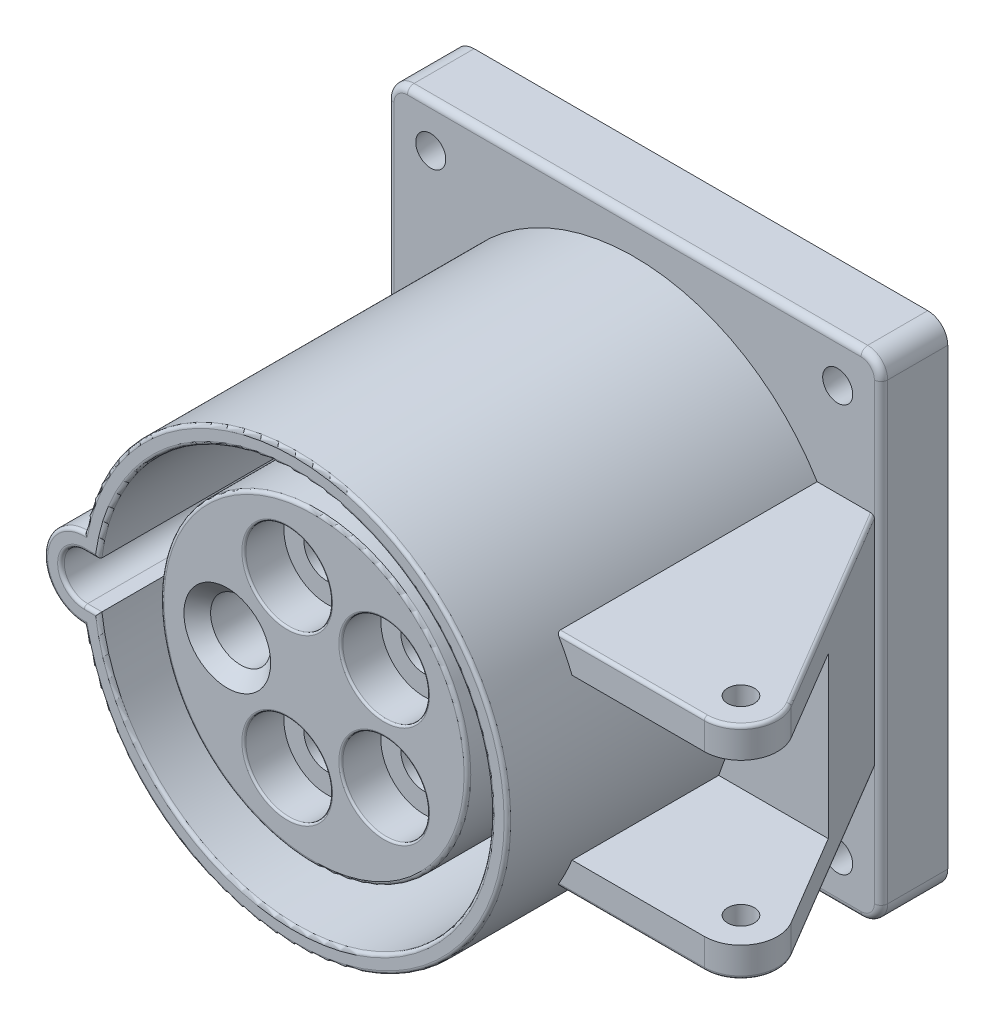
ISO-10303-21;
HEADER;
FILE_DESCRIPTION(('STEP AP214'),'2;1');
FILE_NAME('part.step','',(''),(''),'','','');
FILE_SCHEMA(('AUTOMOTIVE_DESIGN { 1 0 10303 214 1 1 1 1 }'));
ENDSEC;
DATA;
#1=APPLICATION_CONTEXT('core data for automotive mechanical design processes');
#2=APPLICATION_PROTOCOL_DEFINITION('international standard','automotive_design',2000,#1);
#3=PRODUCT_CONTEXT('',#1,'mechanical');
#4=PRODUCT('Part','Part','',(#3));
#5=PRODUCT_RELATED_PRODUCT_CATEGORY('part','',(#4));
#6=PRODUCT_DEFINITION_FORMATION('','',#4);
#7=PRODUCT_DEFINITION_CONTEXT('part definition',#1,'design');
#8=PRODUCT_DEFINITION('design','',#6,#7);
#9=PRODUCT_DEFINITION_SHAPE('','',#8);
#10=(LENGTH_UNIT() NAMED_UNIT(*) SI_UNIT(.MILLI.,.METRE.));
#11=(NAMED_UNIT(*) PLANE_ANGLE_UNIT() SI_UNIT($,.RADIAN.));
#12=(NAMED_UNIT(*) SI_UNIT($,.STERADIAN.) SOLID_ANGLE_UNIT());
#13=UNCERTAINTY_MEASURE_WITH_UNIT(LENGTH_MEASURE(1.E-05),#10,'distance_accuracy_value','');
#14=(GEOMETRIC_REPRESENTATION_CONTEXT(3) GLOBAL_UNCERTAINTY_ASSIGNED_CONTEXT((#13)) GLOBAL_UNIT_ASSIGNED_CONTEXT((#10,
#11,#12)) REPRESENTATION_CONTEXT('',''));
#15=CARTESIAN_POINT('',(0.,0.,0.));
#16=DIRECTION('',(0.,0.,1.));
#17=DIRECTION('',(1.,0.,0.));
#18=AXIS2_PLACEMENT_3D('',#15,#16,#17);
#19=CARTESIAN_POINT('',(-4.01722092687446,-12.363734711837,-34.));
#20=DIRECTION('',(0.,0.,1.));
#21=DIRECTION('',(1.,0.,0.));
#22=AXIS2_PLACEMENT_3D('',#19,#20,#21);
#23=CYLINDRICAL_SURFACE('',#22,3.5);
#24=CARTESIAN_POINT('',(-4.01722092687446,-12.363734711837,9.));
#25=DIRECTION('',(0.,0.,-1.));
#26=DIRECTION('',(-1.,0.,0.));
#27=AXIS2_PLACEMENT_3D('',#24,#25,#26);
#28=CIRCLE('',#27,3.5);
#29=CARTESIAN_POINT('',(-7.51722092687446,-12.363734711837,9.));
#30=VERTEX_POINT('',#29);
#31=EDGE_CURVE('E1008',#30,#30,#28,.T.);
#32=ORIENTED_EDGE('',*,*,#31,.T.);
#33=EDGE_LOOP('',(#32));
#34=FACE_BOUND('',#33,.T.);
#35=CARTESIAN_POINT('',(-4.01722092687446,-12.363734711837,52.));
#36=DIRECTION('',(0.,0.,1.));
#37=DIRECTION('',(1.,0.,0.));
#38=AXIS2_PLACEMENT_3D('',#35,#36,#37);
#39=CIRCLE('',#38,3.5);
#40=CARTESIAN_POINT('',(-0.517220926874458,-12.363734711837,52.));
#41=VERTEX_POINT('',#40);
#42=EDGE_CURVE('E1011',#41,#41,#39,.F.);
#43=ORIENTED_EDGE('',*,*,#42,.F.);
#44=EDGE_LOOP('',(#43));
#45=FACE_BOUND('',#44,.T.);
#46=ADVANCED_FACE('F37',(#34,#45),#23,.F.);
#47=CARTESIAN_POINT('',(10.5172209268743,-7.64120827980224,-34.));
#48=DIRECTION('',(0.,0.,1.));
#49=DIRECTION('',(1.,0.,0.));
#50=AXIS2_PLACEMENT_3D('',#47,#48,#49);
#51=CYLINDRICAL_SURFACE('',#50,3.5);
#52=CARTESIAN_POINT('',(10.5172209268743,-7.64120827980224,9.));
#53=DIRECTION('',(0.,0.,-1.));
#54=DIRECTION('',(-1.,0.,0.));
#55=AXIS2_PLACEMENT_3D('',#52,#53,#54);
#56=CIRCLE('',#55,3.5);
#57=CARTESIAN_POINT('',(7.01722092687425,-7.64120827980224,9.));
#58=VERTEX_POINT('',#57);
#59=EDGE_CURVE('E1010',#58,#58,#56,.T.);
#60=ORIENTED_EDGE('',*,*,#59,.T.);
#61=EDGE_LOOP('',(#60));
#62=FACE_BOUND('',#61,.T.);
#63=CARTESIAN_POINT('',(10.5172209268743,-7.64120827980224,52.));
#64=DIRECTION('',(0.,0.,1.));
#65=DIRECTION('',(1.,0.,0.));
#66=AXIS2_PLACEMENT_3D('',#63,#64,#65);
#67=CIRCLE('',#66,3.5);
#68=CARTESIAN_POINT('',(14.0172209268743,-7.64120827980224,52.));
#69=VERTEX_POINT('',#68);
#70=EDGE_CURVE('E1029',#69,#69,#67,.F.);
#71=ORIENTED_EDGE('',*,*,#70,.F.);
#72=EDGE_LOOP('',(#71));
#73=FACE_BOUND('',#72,.T.);
#74=ADVANCED_FACE('F595',(#62,#73),#51,.F.);
#75=CARTESIAN_POINT('',(10.5172209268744,7.6412082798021,-34.));
#76=DIRECTION('',(0.,0.,1.));
#77=DIRECTION('',(1.,0.,0.));
#78=AXIS2_PLACEMENT_3D('',#75,#76,#77);
#79=CYLINDRICAL_SURFACE('',#78,3.5);
#80=CARTESIAN_POINT('',(10.5172209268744,7.6412082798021,9.));
#81=DIRECTION('',(0.,0.,-1.));
#82=DIRECTION('',(-1.,0.,0.));
#83=AXIS2_PLACEMENT_3D('',#80,#81,#82);
#84=CIRCLE('',#83,3.5);
#85=CARTESIAN_POINT('',(7.01722092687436,7.6412082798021,9.));
#86=VERTEX_POINT('',#85);
#87=EDGE_CURVE('E1014',#86,#86,#84,.T.);
#88=ORIENTED_EDGE('',*,*,#87,.T.);
#89=EDGE_LOOP('',(#88));
#90=FACE_BOUND('',#89,.T.);
#91=CARTESIAN_POINT('',(10.5172209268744,7.6412082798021,52.));
#92=DIRECTION('',(0.,0.,1.));
#93=DIRECTION('',(1.,0.,0.));
#94=AXIS2_PLACEMENT_3D('',#91,#92,#93);
#95=CIRCLE('',#94,3.5);
#96=CARTESIAN_POINT('',(14.0172209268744,7.6412082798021,52.));
#97=VERTEX_POINT('',#96);
#98=EDGE_CURVE('E1025',#97,#97,#95,.F.);
#99=ORIENTED_EDGE('',*,*,#98,.F.);
#100=EDGE_LOOP('',(#99));
#101=FACE_BOUND('',#100,.T.);
#102=ADVANCED_FACE('F601',(#90,#101),#79,.F.);
#103=CARTESIAN_POINT('',(-4.01722092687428,12.363734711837,-34.));
#104=DIRECTION('',(0.,0.,1.));
#105=DIRECTION('',(1.,0.,0.));
#106=AXIS2_PLACEMENT_3D('',#103,#104,#105);
#107=CYLINDRICAL_SURFACE('',#106,3.5);
#108=CARTESIAN_POINT('',(-4.01722092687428,12.363734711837,9.));
#109=DIRECTION('',(0.,0.,-1.));
#110=DIRECTION('',(-1.,0.,0.));
#111=AXIS2_PLACEMENT_3D('',#108,#109,#110);
#112=CIRCLE('',#111,3.5);
#113=CARTESIAN_POINT('',(-7.51722092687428,12.363734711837,9.));
#114=VERTEX_POINT('',#113);
#115=EDGE_CURVE('E1017',#114,#114,#112,.T.);
#116=ORIENTED_EDGE('',*,*,#115,.T.);
#117=EDGE_LOOP('',(#116));
#118=FACE_BOUND('',#117,.T.);
#119=CARTESIAN_POINT('',(-4.01722092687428,12.363734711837,52.));
#120=DIRECTION('',(0.,0.,1.));
#121=DIRECTION('',(1.,0.,0.));
#122=AXIS2_PLACEMENT_3D('',#119,#120,#121);
#123=CIRCLE('',#122,3.5);
#124=CARTESIAN_POINT('',(-0.517220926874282,12.363734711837,52.));
#125=VERTEX_POINT('',#124);
#126=EDGE_CURVE('E1022',#125,#125,#123,.F.);
#127=ORIENTED_EDGE('',*,*,#126,.F.);
#128=EDGE_LOOP('',(#127));
#129=FACE_BOUND('',#128,.T.);
#130=ADVANCED_FACE('F1351',(#118,#129),#107,.F.);
#131=CARTESIAN_POINT('',(49.5,-16.5,43.5));
#132=DIRECTION('',(0.,1.,0.));
#133=DIRECTION('',(0.,0.,1.));
#134=AXIS2_PLACEMENT_3D('',#131,#132,#133);
#135=CYLINDRICAL_SURFACE('',#134,1.99999999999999);
#136=CARTESIAN_POINT('',(49.5,-12.,43.5));
#137=DIRECTION('',(0.,-1.,0.));
#138=DIRECTION('',(0.,0.,-1.));
#139=AXIS2_PLACEMENT_3D('',#136,#137,#138);
#140=CIRCLE('',#139,1.99999999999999);
#141=CARTESIAN_POINT('',(49.5,-12.,41.5));
#142=VERTEX_POINT('',#141);
#143=EDGE_CURVE('E319',#142,#142,#140,.F.);
#144=ORIENTED_EDGE('',*,*,#143,.T.);
#145=EDGE_LOOP('',(#144));
#146=FACE_BOUND('',#145,.T.);
#147=CARTESIAN_POINT('',(49.5,-16.5,43.5));
#148=DIRECTION('',(0.,1.,0.));
#149=DIRECTION('',(0.,0.,1.));
#150=AXIS2_PLACEMENT_3D('',#147,#148,#149);
#151=CIRCLE('',#150,1.99999999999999);
#152=CARTESIAN_POINT('',(49.5,-16.5,45.5));
#153=VERTEX_POINT('',#152);
#154=EDGE_CURVE('E327',#153,#153,#151,.T.);
#155=ORIENTED_EDGE('',*,*,#154,.F.);
#156=EDGE_LOOP('',(#155));
#157=FACE_BOUND('',#156,.T.);
#158=ADVANCED_FACE('F629',(#146,#157),#135,.F.);
#159=CARTESIAN_POINT('',(49.5,-16.5,48.9890222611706));
#160=DIRECTION('',(0.,0.,1.));
#161=DIRECTION('',(1.,0.,0.));
#162=AXIS2_PLACEMENT_3D('',#159,#160,#161);
#163=PLANE('',#162);
#164=CARTESIAN_POINT('',(0.,0.,48.9890222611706));
#165=DIRECTION('',(0.,0.,1.));
#166=DIRECTION('',(1.,0.,0.));
#167=AXIS2_PLACEMENT_3D('',#164,#165,#166);
#168=CIRCLE('',#167,32.);
#169=CARTESIAN_POINT('',(27.712812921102,-16.,48.9890222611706));
#170=VERTEX_POINT('',#169);
#171=CARTESIAN_POINT('',(29.6647939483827,-12.,48.9890222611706));
#172=VERTEX_POINT('',#171);
#173=EDGE_CURVE('E347',#170,#172,#168,.T.);
#174=ORIENTED_EDGE('',*,*,#173,.F.);
#175=DIRECTION('',(1.,0.,0.));
#176=VECTOR('',#175,1.);
#177=CARTESIAN_POINT('',(49.5,-16.,48.9890222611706));
#178=LINE('',#177,#176);
#179=CARTESIAN_POINT('',(49.5,-16.,48.9890222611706));
#180=VERTEX_POINT('',#179);
#181=EDGE_CURVE('E877',#170,#180,#178,.T.);
#182=ORIENTED_EDGE('',*,*,#181,.T.);
#183=DIRECTION('',(0.,1.,0.));
#184=VECTOR('',#183,1.);
#185=CARTESIAN_POINT('',(49.5,-16.5,48.9890222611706));
#186=LINE('',#185,#184);
#187=CARTESIAN_POINT('',(49.5,-12.,48.9890222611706));
#188=VERTEX_POINT('',#187);
#189=EDGE_CURVE('E333',#180,#188,#186,.T.);
#190=ORIENTED_EDGE('',*,*,#189,.T.);
#191=DIRECTION('',(1.,0.,0.));
#192=VECTOR('',#191,1.);
#193=CARTESIAN_POINT('',(49.5,-12.,48.9890222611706));
#194=LINE('',#193,#192);
#195=EDGE_CURVE('E314',#172,#188,#194,.T.);
#196=ORIENTED_EDGE('',*,*,#195,.F.);
#197=EDGE_LOOP('',(#174,#182,#190,#196));
#198=FACE_BOUND('',#197,.T.);
#199=ADVANCED_FACE('F637',(#198),#163,.T.);
#200=CARTESIAN_POINT('',(49.5,-16.5,43.5));
#201=DIRECTION('',(0.,1.,0.));
#202=DIRECTION('',(0.,0.,1.));
#203=AXIS2_PLACEMENT_3D('',#200,#201,#202);
#204=CYLINDRICAL_SURFACE('',#203,5.48902226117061);
#205=ORIENTED_EDGE('',*,*,#189,.F.);
#206=CARTESIAN_POINT('',(49.5,-16.,43.5));
#207=DIRECTION('',(0.,1.,0.));
#208=DIRECTION('',(0.,0.,1.));
#209=AXIS2_PLACEMENT_3D('',#206,#207,#208);
#210=CIRCLE('',#209,5.48902226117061);
#211=CARTESIAN_POINT('',(54.2202317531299,-16.,40.6984330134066));
#212=VERTEX_POINT('',#211);
#213=EDGE_CURVE('E873',#180,#212,#210,.T.);
#214=ORIENTED_EDGE('',*,*,#213,.T.);
#215=DIRECTION('',(0.,1.,0.));
#216=VECTOR('',#215,1.);
#217=CARTESIAN_POINT('',(54.2202317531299,-16.5,40.6984330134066));
#218=LINE('',#217,#216);
#219=CARTESIAN_POINT('',(54.2202317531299,-12.,40.6984330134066));
#220=VERTEX_POINT('',#219);
#221=EDGE_CURVE('E339',#212,#220,#218,.T.);
#222=ORIENTED_EDGE('',*,*,#221,.T.);
#223=CARTESIAN_POINT('',(49.5,-12.,43.5));
#224=DIRECTION('',(0.,-1.,0.));
#225=DIRECTION('',(0.,0.,-1.));
#226=AXIS2_PLACEMENT_3D('',#223,#224,#225);
#227=CIRCLE('',#226,5.48902226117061);
#228=EDGE_CURVE('E844',#188,#220,#227,.F.);
#229=ORIENTED_EDGE('',*,*,#228,.F.);
#230=EDGE_LOOP('',(#205,#214,#222,#229));
#231=FACE_BOUND('',#230,.T.);
#232=ADVANCED_FACE('F644',(#231),#204,.T.);
#233=CARTESIAN_POINT('',(0.,0.,10.));
#234=DIRECTION('',(0.,0.,-1.));
#235=DIRECTION('',(-1.,0.,0.));
#236=AXIS2_PLACEMENT_3D('',#233,#234,#235);
#237=PLANE('',#236);
#238=CARTESIAN_POINT('',(30.5,-30.5,10.));
#239=DIRECTION('',(0.,0.,1.));
#240=DIRECTION('',(1.,0.,0.));
#241=AXIS2_PLACEMENT_3D('',#238,#239,#240);
#242=CIRCLE('',#241,2.25);
#243=CARTESIAN_POINT('',(32.75,-30.5,10.));
#244=VERTEX_POINT('',#243);
#245=EDGE_CURVE('E354',#244,#244,#242,.T.);
#246=ORIENTED_EDGE('',*,*,#245,.F.);
#247=EDGE_LOOP('',(#246));
#248=FACE_BOUND('',#247,.T.);
#249=CARTESIAN_POINT('',(-30.5,-30.5,10.));
#250=DIRECTION('',(0.,0.,1.));
#251=DIRECTION('',(1.,0.,0.));
#252=AXIS2_PLACEMENT_3D('',#249,#250,#251);
#253=CIRCLE('',#252,2.25);
#254=CARTESIAN_POINT('',(-28.25,-30.5,10.));
#255=VERTEX_POINT('',#254);
#256=EDGE_CURVE('E350',#255,#255,#253,.T.);
#257=ORIENTED_EDGE('',*,*,#256,.F.);
#258=EDGE_LOOP('',(#257));
#259=FACE_BOUND('',#258,.T.);
#260=DIRECTION('',(0.,1.,0.));
#261=VECTOR('',#260,1.);
#262=CARTESIAN_POINT('',(36.,0.,10.));
#263=LINE('',#262,#261);
#264=CARTESIAN_POINT('',(36.,-34.,10.));
#265=VERTEX_POINT('',#264);
#266=CARTESIAN_POINT('',(36.,-16.,10.));
#267=VERTEX_POINT('',#266);
#268=EDGE_CURVE('E458',#265,#267,#263,.T.);
#269=ORIENTED_EDGE('',*,*,#268,.T.);
#270=CARTESIAN_POINT('',(35.4185643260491,-16.,10.));
#271=DIRECTION('',(0.,0.,-1.));
#272=DIRECTION('',(1.,0.,0.));
#273=AXIS2_PLACEMENT_3D('',#270,#271,#272);
#274=ELLIPSE('',#273,0.581435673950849,0.5);
#275=CARTESIAN_POINT('',(35.4185643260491,-16.5,10.));
#276=VERTEX_POINT('',#275);
#277=EDGE_CURVE('E881',#267,#276,#274,.T.);
#278=ORIENTED_EDGE('',*,*,#277,.T.);
#279=DIRECTION('',(-1.,0.,0.));
#280=VECTOR('',#279,1.);
#281=CARTESIAN_POINT('',(25.8236447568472,-16.5,10.));
#282=LINE('',#281,#280);
#283=CARTESIAN_POINT('',(27.4180597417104,-16.5,10.));
#284=VERTEX_POINT('',#283);
#285=EDGE_CURVE('E330',#276,#284,#282,.T.);
#286=ORIENTED_EDGE('',*,*,#285,.T.);
#287=CARTESIAN_POINT('',(0.,0.,10.));
#288=DIRECTION('',(0.,0.,-1.));
#289=DIRECTION('',(-1.,0.,0.));
#290=AXIS2_PLACEMENT_3D('',#287,#288,#289);
#291=CIRCLE('',#290,32.);
#292=CARTESIAN_POINT('',(-31.4324674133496,-5.99999935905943,10.));
#293=VERTEX_POINT('',#292);
#294=EDGE_CURVE('E411',#293,#284,#291,.F.);
#295=ORIENTED_EDGE('',*,*,#294,.F.);
#296=CARTESIAN_POINT('',(-31.4296940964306,0.,10.));
#297=DIRECTION('',(0.,0.,-1.));
#298=DIRECTION('',(-1.,0.,0.));
#299=AXIS2_PLACEMENT_3D('',#296,#297,#298);
#300=CIRCLE('',#299,6.);
#301=CARTESIAN_POINT('',(-36.,-3.88745468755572,10.));
#302=VERTEX_POINT('',#301);
#303=EDGE_CURVE('E387',#302,#293,#300,.F.);
#304=ORIENTED_EDGE('',*,*,#303,.F.);
#305=DIRECTION('',(0.,-1.,0.));
#306=VECTOR('',#305,1.);
#307=CARTESIAN_POINT('',(-36.,0.,10.));
#308=LINE('',#307,#306);
#309=CARTESIAN_POINT('',(-36.,-34.,10.));
#310=VERTEX_POINT('',#309);
#311=EDGE_CURVE('E467',#302,#310,#308,.T.);
#312=ORIENTED_EDGE('',*,*,#311,.T.);
#313=CARTESIAN_POINT('',(-34.,-34.,10.));
#314=DIRECTION('',(0.,0.,-1.));
#315=DIRECTION('',(-1.,0.,0.));
#316=AXIS2_PLACEMENT_3D('',#313,#314,#315);
#317=CIRCLE('',#316,2.);
#318=CARTESIAN_POINT('',(-34.,-36.,10.));
#319=VERTEX_POINT('',#318);
#320=EDGE_CURVE('E465',#310,#319,#317,.F.);
#321=ORIENTED_EDGE('',*,*,#320,.T.);
#322=DIRECTION('',(1.,0.,0.));
#323=VECTOR('',#322,1.);
#324=CARTESIAN_POINT('',(0.,-36.,10.));
#325=LINE('',#324,#323);
#326=CARTESIAN_POINT('',(34.,-36.,10.));
#327=VERTEX_POINT('',#326);
#328=EDGE_CURVE('E463',#319,#327,#325,.T.);
#329=ORIENTED_EDGE('',*,*,#328,.T.);
#330=CARTESIAN_POINT('',(34.,-34.,10.));
#331=DIRECTION('',(0.,0.,-1.));
#332=DIRECTION('',(-1.,0.,0.));
#333=AXIS2_PLACEMENT_3D('',#330,#331,#332);
#334=CIRCLE('',#333,2.);
#335=EDGE_CURVE('E461',#327,#265,#334,.F.);
#336=ORIENTED_EDGE('',*,*,#335,.T.);
#337=EDGE_LOOP('',(#269,#278,#286,#295,#304,#312,#321,#329,#336));
#338=FACE_BOUND('',#337,.T.);
#339=ADVANCED_FACE('F543',(#248,#259,#338),#237,.F.);
#340=CARTESIAN_POINT('',(0.,0.,61.));
#341=DIRECTION('',(0.,0.,-1.));
#342=DIRECTION('',(-1.,0.,0.));
#343=AXIS2_PLACEMENT_3D('',#340,#341,#342);
#344=CYLINDRICAL_SURFACE('',#343,32.);
#345=CARTESIAN_POINT('',(0.,0.,60.5));
#346=DIRECTION('',(0.,0.,1.));
#347=DIRECTION('',(1.,0.,0.));
#348=AXIS2_PLACEMENT_3D('',#345,#346,#347);
#349=CIRCLE('',#348,32.);
#350=CARTESIAN_POINT('',(-31.4324674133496,5.99999935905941,60.5));
#351=VERTEX_POINT('',#350);
#352=CARTESIAN_POINT('',(-31.4324674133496,-5.99999935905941,60.5));
#353=VERTEX_POINT('',#352);
#354=EDGE_CURVE('E832',#351,#353,#349,.F.);
#355=ORIENTED_EDGE('',*,*,#354,.T.);
#356=DIRECTION('',(0.,0.,1.));
#357=VECTOR('',#356,1.);
#358=CARTESIAN_POINT('',(-31.4324674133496,-5.99999935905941,35.5));
#359=LINE('',#358,#357);
#360=EDGE_CURVE('E414',#353,#293,#359,.F.);
#361=ORIENTED_EDGE('',*,*,#360,.T.);
#362=ORIENTED_EDGE('',*,*,#294,.T.);
#363=DIRECTION('',(0.,0.,-1.));
#364=VECTOR('',#363,1.);
#365=CARTESIAN_POINT('',(27.4180597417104,-16.5,61.));
#366=LINE('',#365,#364);
#367=CARTESIAN_POINT('',(27.4180597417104,-16.5,48.4890222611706));
#368=VERTEX_POINT('',#367);
#369=EDGE_CURVE('E343',#368,#284,#366,.T.);
#370=ORIENTED_EDGE('',*,*,#369,.F.);
#371=CARTESIAN_POINT('',(27.4180597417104,-16.5,48.4890222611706));
#372=CARTESIAN_POINT('',(27.4180385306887,-16.5000335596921,48.5143159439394));
#373=CARTESIAN_POINT('',(27.4192133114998,-16.4980831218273,48.5395785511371));
#374=CARTESIAN_POINT('',(27.4237822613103,-16.4904881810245,48.5892203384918));
#375=CARTESIAN_POINT('',(27.427166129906,-16.4848608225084,48.6136030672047));
#376=CARTESIAN_POINT('',(27.4359791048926,-16.4701887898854,48.6608874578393));
#377=CARTESIAN_POINT('',(27.4414061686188,-16.4611475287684,48.683790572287));
#378=CARTESIAN_POINT('',(27.4540463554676,-16.440057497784,48.7276469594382));
#379=CARTESIAN_POINT('',(27.4612611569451,-16.4280059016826,48.7485983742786));
#380=CARTESIAN_POINT('',(27.4776347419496,-16.4006053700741,48.7892721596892));
#381=CARTESIAN_POINT('',(27.486879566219,-16.3851099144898,48.808860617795));
#382=CARTESIAN_POINT('',(27.5067053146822,-16.3518053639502,48.8451690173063));
#383=CARTESIAN_POINT('',(27.5172865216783,-16.3339957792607,48.861888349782));
#384=CARTESIAN_POINT('',(27.5409935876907,-16.2939952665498,48.8943836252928));
#385=CARTESIAN_POINT('',(27.5542697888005,-16.271537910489,48.9097216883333));
#386=CARTESIAN_POINT('',(27.5817705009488,-16.224878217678,48.9364075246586));
#387=CARTESIAN_POINT('',(27.5959960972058,-16.2006738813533,48.9477506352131));
#388=CARTESIAN_POINT('',(27.6271081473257,-16.1475682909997,48.9677059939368));
#389=CARTESIAN_POINT('',(27.6440855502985,-16.1184882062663,48.9757015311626));
#390=CARTESIAN_POINT('',(27.6783341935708,-16.0596079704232,48.9863560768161));
#391=CARTESIAN_POINT('',(27.6956048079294,-16.02980930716,48.9890252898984));
#392=CARTESIAN_POINT('',(27.712812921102,-16.,48.9890222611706));
#393=B_SPLINE_CURVE_WITH_KNOTS('',3,(#371,#372,#373,#374,#375,#376,#377,#378,#379,#380,#381,
#382,#383,#384,#385,#386,#387,#388,#389,#390,#391,#392),.UNSPECIFIED.,.F.,.F.,(4,2,2,2,2,2,2,2,
2,2,4),(0.,0.0757298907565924,0.151109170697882,0.226413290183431,0.30178837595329,
0.381371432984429,0.460971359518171,0.551401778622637,0.641937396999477,0.745332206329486,
0.848528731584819),.UNSPECIFIED.);
#394=EDGE_CURVE('E555',#368,#170,#393,.T.);
#395=ORIENTED_EDGE('',*,*,#394,.T.);
#396=ORIENTED_EDGE('',*,*,#173,.T.);
#397=DIRECTION('',(0.,0.,1.));
#398=VECTOR('',#397,1.);
#399=CARTESIAN_POINT('',(29.6647939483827,-12.,27.));
#400=LINE('',#399,#398);
#401=CARTESIAN_POINT('',(29.6647939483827,-12.,27.));
#402=VERTEX_POINT('',#401);
#403=EDGE_CURVE('E299',#402,#172,#400,.T.);
#404=ORIENTED_EDGE('',*,*,#403,.F.);
#405=CARTESIAN_POINT('',(0.,0.,27.));
#406=DIRECTION('',(0.,0.,-1.));
#407=DIRECTION('',(1.,0.,0.));
#408=AXIS2_PLACEMENT_3D('',#405,#406,#407);
#409=CIRCLE('',#408,32.);
#410=CARTESIAN_POINT('',(29.6647939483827,12.,27.));
#411=VERTEX_POINT('',#410);
#412=EDGE_CURVE('E283',#411,#402,#409,.T.);
#413=ORIENTED_EDGE('',*,*,#412,.F.);
#414=DIRECTION('',(0.,0.,1.));
#415=VECTOR('',#414,1.);
#416=CARTESIAN_POINT('',(29.6647939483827,12.,27.));
#417=LINE('',#416,#415);
#418=CARTESIAN_POINT('',(29.6647939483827,12.,48.9890222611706));
#419=VERTEX_POINT('',#418);
#420=EDGE_CURVE('E291',#411,#419,#417,.T.);
#421=ORIENTED_EDGE('',*,*,#420,.T.);
#422=CARTESIAN_POINT('',(27.712812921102,16.,48.9890222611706));
#423=VERTEX_POINT('',#422);
#424=EDGE_CURVE('E346',#419,#423,#168,.T.);
#425=ORIENTED_EDGE('',*,*,#424,.T.);
#426=CARTESIAN_POINT('',(27.712812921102,16.,48.9890222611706));
#427=CARTESIAN_POINT('',(27.6915355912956,16.0368628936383,48.9890331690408));
#428=CARTESIAN_POINT('',(27.6701453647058,16.0737328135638,48.9849441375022));
#429=CARTESIAN_POINT('',(27.6278952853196,16.1462407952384,48.9686062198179));
#430=CARTESIAN_POINT('',(27.6070394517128,16.1818699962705,48.9563078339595));
#431=CARTESIAN_POINT('',(27.5696172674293,16.2455347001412,48.9258115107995));
#432=CARTESIAN_POINT('',(27.5528527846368,16.2739447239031,48.9086399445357));
#433=CARTESIAN_POINT('',(27.5212327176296,16.3273605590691,48.8684239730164));
#434=CARTESIAN_POINT('',(27.5063702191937,16.3523787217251,48.8454018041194));
#435=CARTESIAN_POINT('',(27.482713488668,16.3920973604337,48.8003466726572));
#436=CARTESIAN_POINT('',(27.4733318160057,16.407812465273,48.7795108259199));
#437=CARTESIAN_POINT('',(27.4564384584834,16.4360657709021,48.7350684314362));
#438=CARTESIAN_POINT('',(27.4489272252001,16.4486032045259,48.7114612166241));
#439=CARTESIAN_POINT('',(27.4361204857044,16.469955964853,48.6618668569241));
#440=CARTESIAN_POINT('',(27.4308388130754,16.478748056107,48.6358660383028));
#441=CARTESIAN_POINT('',(27.4228970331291,16.4919611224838,48.5824360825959));
#442=CARTESIAN_POINT('',(27.4202303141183,16.4963931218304,48.5550107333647));
#443=CARTESIAN_POINT('',(27.4183534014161,16.4995119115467,48.5146175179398));
#444=CARTESIAN_POINT('',(27.4180552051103,16.5000072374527,48.5018162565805));
#445=CARTESIAN_POINT('',(27.4180597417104,16.5,48.4890222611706));
#446=B_SPLINE_CURVE_WITH_KNOTS('',3,(#426,#427,#428,#429,#430,#431,#432,#433,#434,#435,#436,
#437,#438,#439,#440,#441,#442,#443,#444,#445),.UNSPECIFIED.,.F.,.F.,(4,2,2,2,2,2,2,2,2,4),(0.,
0.127607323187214,0.255991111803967,0.366962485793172,0.47751823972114,0.560376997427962,
0.643255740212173,0.726641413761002,0.809815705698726,0.848205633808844),.UNSPECIFIED.);
#447=CARTESIAN_POINT('',(27.4180597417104,16.5,48.4890222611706));
#448=VERTEX_POINT('',#447);
#449=EDGE_CURVE('E548',#423,#448,#446,.T.);
#450=ORIENTED_EDGE('',*,*,#449,.T.);
#451=DIRECTION('',(0.,0.,-1.));
#452=VECTOR('',#451,1.);
#453=CARTESIAN_POINT('',(27.4180597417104,16.5,61.));
#454=LINE('',#453,#452);
#455=CARTESIAN_POINT('',(27.4180597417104,16.5,10.));
#456=VERTEX_POINT('',#455);
#457=EDGE_CURVE('E335',#448,#456,#454,.T.);
#458=ORIENTED_EDGE('',*,*,#457,.T.);
#459=CARTESIAN_POINT('',(-31.4324674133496,5.99999935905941,10.));
#460=VERTEX_POINT('',#459);
#461=EDGE_CURVE('E410',#456,#460,#291,.F.);
#462=ORIENTED_EDGE('',*,*,#461,.T.);
#463=DIRECTION('',(0.,0.,1.));
#464=VECTOR('',#463,1.);
#465=CARTESIAN_POINT('',(-31.4324674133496,5.99999935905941,35.5));
#466=LINE('',#465,#464);
#467=EDGE_CURVE('E416',#460,#351,#466,.T.);
#468=ORIENTED_EDGE('',*,*,#467,.T.);
#469=EDGE_LOOP('',(#355,#361,#362,#370,#395,#396,#404,#413,#421,#425,#450,#458,#462,#468));
#470=FACE_BOUND('',#469,.T.);
#471=ADVANCED_FACE('F301',(#470),#344,.T.);
#472=CARTESIAN_POINT('',(37.,-37.,10.));
#473=DIRECTION('',(-1.,0.,0.));
#474=DIRECTION('',(0.,0.,1.));
#475=AXIS2_PLACEMENT_3D('',#472,#473,#474);
#476=PLANE('',#475);
#477=DIRECTION('',(0.,0.,-1.));
#478=VECTOR('',#477,1.);
#479=CARTESIAN_POINT('',(37.,34.,10.));
#480=LINE('',#479,#478);
#481=CARTESIAN_POINT('',(37.,34.,0.));
#482=VERTEX_POINT('',#481);
#483=CARTESIAN_POINT('',(37.,34.,9.));
#484=VERTEX_POINT('',#483);
#485=EDGE_CURVE('E434',#482,#484,#480,.F.);
#486=ORIENTED_EDGE('',*,*,#485,.T.);
#487=DIRECTION('',(0.,1.,0.));
#488=VECTOR('',#487,1.);
#489=CARTESIAN_POINT('',(37.,-37.,9.));
#490=LINE('',#489,#488);
#491=CARTESIAN_POINT('',(37.,-34.,9.));
#492=VERTEX_POINT('',#491);
#493=EDGE_CURVE('E486',#484,#492,#490,.F.);
#494=ORIENTED_EDGE('',*,*,#493,.T.);
#495=DIRECTION('',(0.,0.,-1.));
#496=VECTOR('',#495,1.);
#497=CARTESIAN_POINT('',(37.,-34.,10.));
#498=LINE('',#497,#496);
#499=CARTESIAN_POINT('',(37.,-34.,0.));
#500=VERTEX_POINT('',#499);
#501=EDGE_CURVE('E432',#492,#500,#498,.T.);
#502=ORIENTED_EDGE('',*,*,#501,.T.);
#503=DIRECTION('',(0.,1.,0.));
#504=VECTOR('',#503,1.);
#505=CARTESIAN_POINT('',(37.,-37.,0.));
#506=LINE('',#505,#504);
#507=EDGE_CURVE('E398',#500,#482,#506,.T.);
#508=ORIENTED_EDGE('',*,*,#507,.T.);
#509=EDGE_LOOP('',(#486,#494,#502,#508));
#510=FACE_BOUND('',#509,.T.);
#511=ADVANCED_FACE('F542',(#510),#476,.F.);
#512=CARTESIAN_POINT('',(-37.,37.,10.));
#513=DIRECTION('',(0.,-1.,0.));
#514=DIRECTION('',(0.,0.,-1.));
#515=AXIS2_PLACEMENT_3D('',#512,#513,#514);
#516=PLANE('',#515);
#517=DIRECTION('',(0.,0.,-1.));
#518=VECTOR('',#517,1.);
#519=CARTESIAN_POINT('',(-34.,37.,10.));
#520=LINE('',#519,#518);
#521=CARTESIAN_POINT('',(-34.,37.,0.));
#522=VERTEX_POINT('',#521);
#523=CARTESIAN_POINT('',(-34.,37.,9.));
#524=VERTEX_POINT('',#523);
#525=EDGE_CURVE('E419',#522,#524,#520,.F.);
#526=ORIENTED_EDGE('',*,*,#525,.T.);
#527=DIRECTION('',(-1.,0.,0.));
#528=VECTOR('',#527,1.);
#529=CARTESIAN_POINT('',(-37.,37.,9.));
#530=LINE('',#529,#528);
#531=CARTESIAN_POINT('',(34.,37.,9.));
#532=VERTEX_POINT('',#531);
#533=EDGE_CURVE('E492',#524,#532,#530,.F.);
#534=ORIENTED_EDGE('',*,*,#533,.T.);
#535=DIRECTION('',(0.,0.,-1.));
#536=VECTOR('',#535,1.);
#537=CARTESIAN_POINT('',(34.,37.,10.));
#538=LINE('',#537,#536);
#539=CARTESIAN_POINT('',(34.,37.,0.));
#540=VERTEX_POINT('',#539);
#541=EDGE_CURVE('E422',#532,#540,#538,.T.);
#542=ORIENTED_EDGE('',*,*,#541,.T.);
#543=DIRECTION('',(-1.,0.,0.));
#544=VECTOR('',#543,1.);
#545=CARTESIAN_POINT('',(-37.,37.,0.));
#546=LINE('',#545,#544);
#547=EDGE_CURVE('E401',#540,#522,#546,.T.);
#548=ORIENTED_EDGE('',*,*,#547,.T.);
#549=EDGE_LOOP('',(#526,#534,#542,#548));
#550=FACE_BOUND('',#549,.T.);
#551=ADVANCED_FACE('F1089',(#550),#516,.F.);
#552=CARTESIAN_POINT('',(-37.,-37.,10.));
#553=DIRECTION('',(1.,0.,0.));
#554=DIRECTION('',(0.,0.,-1.));
#555=AXIS2_PLACEMENT_3D('',#552,#553,#554);
#556=PLANE('',#555);
#557=DIRECTION('',(0.,0.,-1.));
#558=VECTOR('',#557,1.);
#559=CARTESIAN_POINT('',(-37.,-34.,10.));
#560=LINE('',#559,#558);
#561=CARTESIAN_POINT('',(-37.,-34.,0.));
#562=VERTEX_POINT('',#561);
#563=CARTESIAN_POINT('',(-37.,-34.,9.));
#564=VERTEX_POINT('',#563);
#565=EDGE_CURVE('E444',#562,#564,#560,.F.);
#566=ORIENTED_EDGE('',*,*,#565,.T.);
#567=DIRECTION('',(0.,-1.,0.));
#568=VECTOR('',#567,1.);
#569=CARTESIAN_POINT('',(-37.,-37.,9.));
#570=LINE('',#569,#568);
#571=CARTESIAN_POINT('',(-37.,-2.22972916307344,9.));
#572=VERTEX_POINT('',#571);
#573=EDGE_CURVE('E477',#564,#572,#570,.F.);
#574=ORIENTED_EDGE('',*,*,#573,.T.);
#575=DIRECTION('',(0.,0.,1.));
#576=VECTOR('',#575,1.);
#577=CARTESIAN_POINT('',(-37.,-2.22972916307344,9.));
#578=LINE('',#577,#576);
#579=CARTESIAN_POINT('',(-37.,-2.22972916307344,10.));
#580=VERTEX_POINT('',#579);
#581=EDGE_CURVE('E475',#572,#580,#578,.T.);
#582=ORIENTED_EDGE('',*,*,#581,.T.);
#583=DIRECTION('',(0.,1.,0.));
#584=VECTOR('',#583,1.);
#585=CARTESIAN_POINT('',(-37.,-37.,10.));
#586=LINE('',#585,#584);
#587=CARTESIAN_POINT('',(-37.,2.22972916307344,10.));
#588=VERTEX_POINT('',#587);
#589=EDGE_CURVE('E393',#580,#588,#586,.T.);
#590=ORIENTED_EDGE('',*,*,#589,.T.);
#591=DIRECTION('',(0.,0.,1.));
#592=VECTOR('',#591,1.);
#593=CARTESIAN_POINT('',(-37.,2.22972916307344,10.));
#594=LINE('',#593,#592);
#595=CARTESIAN_POINT('',(-37.,2.22972916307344,9.));
#596=VERTEX_POINT('',#595);
#597=EDGE_CURVE('E472',#588,#596,#594,.F.);
#598=ORIENTED_EDGE('',*,*,#597,.T.);
#599=DIRECTION('',(0.,-1.,0.));
#600=VECTOR('',#599,1.);
#601=CARTESIAN_POINT('',(-37.,-37.,9.));
#602=LINE('',#601,#600);
#603=CARTESIAN_POINT('',(-37.,34.,9.));
#604=VERTEX_POINT('',#603);
#605=EDGE_CURVE('E470',#596,#604,#602,.F.);
#606=ORIENTED_EDGE('',*,*,#605,.T.);
#607=DIRECTION('',(0.,0.,-1.));
#608=VECTOR('',#607,1.);
#609=CARTESIAN_POINT('',(-37.,34.,10.));
#610=LINE('',#609,#608);
#611=CARTESIAN_POINT('',(-37.,34.,0.));
#612=VERTEX_POINT('',#611);
#613=EDGE_CURVE('E442',#604,#612,#610,.T.);
#614=ORIENTED_EDGE('',*,*,#613,.T.);
#615=DIRECTION('',(0.,-1.,0.));
#616=VECTOR('',#615,1.);
#617=CARTESIAN_POINT('',(-37.,-37.,0.));
#618=LINE('',#617,#616);
#619=EDGE_CURVE('E404',#612,#562,#618,.T.);
#620=ORIENTED_EDGE('',*,*,#619,.T.);
#621=EDGE_LOOP('',(#566,#574,#582,#590,#598,#606,#614,#620));
#622=FACE_BOUND('',#621,.T.);
#623=ADVANCED_FACE('F972',(#622),#556,.F.);
#624=CARTESIAN_POINT('',(-37.,-37.,10.));
#625=DIRECTION('',(0.,1.,0.));
#626=DIRECTION('',(0.,0.,1.));
#627=AXIS2_PLACEMENT_3D('',#624,#625,#626);
#628=PLANE('',#627);
#629=DIRECTION('',(0.,0.,-1.));
#630=VECTOR('',#629,1.);
#631=CARTESIAN_POINT('',(34.,-37.,10.));
#632=LINE('',#631,#630);
#633=CARTESIAN_POINT('',(34.,-37.,0.));
#634=VERTEX_POINT('',#633);
#635=CARTESIAN_POINT('',(34.,-37.,9.));
#636=VERTEX_POINT('',#635);
#637=EDGE_CURVE('E439',#634,#636,#632,.F.);
#638=ORIENTED_EDGE('',*,*,#637,.T.);
#639=DIRECTION('',(1.,0.,0.));
#640=VECTOR('',#639,1.);
#641=CARTESIAN_POINT('',(-37.,-37.,9.));
#642=LINE('',#641,#640);
#643=CARTESIAN_POINT('',(-34.,-37.,9.));
#644=VERTEX_POINT('',#643);
#645=EDGE_CURVE('E482',#636,#644,#642,.F.);
#646=ORIENTED_EDGE('',*,*,#645,.T.);
#647=DIRECTION('',(0.,0.,-1.));
#648=VECTOR('',#647,1.);
#649=CARTESIAN_POINT('',(-34.,-37.,10.));
#650=LINE('',#649,#648);
#651=CARTESIAN_POINT('',(-34.,-37.,0.));
#652=VERTEX_POINT('',#651);
#653=EDGE_CURVE('E437',#644,#652,#650,.T.);
#654=ORIENTED_EDGE('',*,*,#653,.T.);
#655=DIRECTION('',(1.,0.,0.));
#656=VECTOR('',#655,1.);
#657=CARTESIAN_POINT('',(-37.,-37.,0.));
#658=LINE('',#657,#656);
#659=EDGE_CURVE('E407',#652,#634,#658,.T.);
#660=ORIENTED_EDGE('',*,*,#659,.T.);
#661=EDGE_LOOP('',(#638,#646,#654,#660));
#662=FACE_BOUND('',#661,.T.);
#663=ADVANCED_FACE('F935',(#662),#628,.F.);
#664=CARTESIAN_POINT('',(30.5,30.5,10.));
#665=DIRECTION('',(0.,0.,1.));
#666=DIRECTION('',(1.,0.,0.));
#667=AXIS2_PLACEMENT_3D('',#664,#665,#666);
#668=CIRCLE('',#667,2.25);
#669=CARTESIAN_POINT('',(32.75,30.5,10.));
#670=VERTEX_POINT('',#669);
#671=EDGE_CURVE('E349',#670,#670,#668,.T.);
#672=ORIENTED_EDGE('',*,*,#671,.F.);
#673=EDGE_LOOP('',(#672));
#674=FACE_BOUND('',#673,.T.);
#675=CARTESIAN_POINT('',(-30.5,30.5,10.));
#676=DIRECTION('',(0.,0.,1.));
#677=DIRECTION('',(1.,0.,0.));
#678=AXIS2_PLACEMENT_3D('',#675,#676,#677);
#679=CIRCLE('',#678,2.25);
#680=CARTESIAN_POINT('',(-28.25,30.5,10.));
#681=VERTEX_POINT('',#680);
#682=EDGE_CURVE('E353',#681,#681,#679,.T.);
#683=ORIENTED_EDGE('',*,*,#682,.F.);
#684=EDGE_LOOP('',(#683));
#685=FACE_BOUND('',#684,.T.);
#686=ORIENTED_EDGE('',*,*,#461,.F.);
#687=DIRECTION('',(-1.,0.,0.));
#688=VECTOR('',#687,1.);
#689=CARTESIAN_POINT('',(25.8236447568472,16.5,10.));
#690=LINE('',#689,#688);
#691=CARTESIAN_POINT('',(35.4185643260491,16.5,10.));
#692=VERTEX_POINT('',#691);
#693=EDGE_CURVE('E325',#692,#456,#690,.T.);
#694=ORIENTED_EDGE('',*,*,#693,.F.);
#695=CARTESIAN_POINT('',(35.4185643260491,16.,10.));
#696=DIRECTION('',(0.,0.,-1.));
#697=DIRECTION('',(-1.,0.,0.));
#698=AXIS2_PLACEMENT_3D('',#695,#696,#697);
#699=ELLIPSE('',#698,0.581435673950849,0.5);
#700=CARTESIAN_POINT('',(36.,16.,10.));
#701=VERTEX_POINT('',#700);
#702=EDGE_CURVE('E879',#692,#701,#699,.T.);
#703=ORIENTED_EDGE('',*,*,#702,.T.);
#704=CARTESIAN_POINT('',(36.,34.,10.));
#705=VERTEX_POINT('',#704);
#706=EDGE_CURVE('E53',#701,#705,#263,.T.);
#707=ORIENTED_EDGE('',*,*,#706,.T.);
#708=CARTESIAN_POINT('',(34.,34.,10.));
#709=DIRECTION('',(0.,0.,-1.));
#710=DIRECTION('',(-1.,0.,0.));
#711=AXIS2_PLACEMENT_3D('',#708,#709,#710);
#712=CIRCLE('',#711,2.);
#713=CARTESIAN_POINT('',(34.,36.,10.));
#714=VERTEX_POINT('',#713);
#715=EDGE_CURVE('E456',#705,#714,#712,.F.);
#716=ORIENTED_EDGE('',*,*,#715,.T.);
#717=DIRECTION('',(-1.,0.,0.));
#718=VECTOR('',#717,1.);
#719=CARTESIAN_POINT('',(0.,36.,10.));
#720=LINE('',#719,#718);
#721=CARTESIAN_POINT('',(-34.,36.,10.));
#722=VERTEX_POINT('',#721);
#723=EDGE_CURVE('E450',#714,#722,#720,.T.);
#724=ORIENTED_EDGE('',*,*,#723,.T.);
#725=CARTESIAN_POINT('',(-34.,34.,10.));
#726=DIRECTION('',(0.,0.,-1.));
#727=DIRECTION('',(-1.,0.,0.));
#728=AXIS2_PLACEMENT_3D('',#725,#726,#727);
#729=CIRCLE('',#728,2.);
#730=CARTESIAN_POINT('',(-36.,34.,10.));
#731=VERTEX_POINT('',#730);
#732=EDGE_CURVE('E452',#722,#731,#729,.F.);
#733=ORIENTED_EDGE('',*,*,#732,.T.);
#734=DIRECTION('',(0.,-1.,0.));
#735=VECTOR('',#734,1.);
#736=CARTESIAN_POINT('',(-36.,0.,10.));
#737=LINE('',#736,#735);
#738=CARTESIAN_POINT('',(-36.,3.88745468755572,10.));
#739=VERTEX_POINT('',#738);
#740=EDGE_CURVE('E454',#731,#739,#737,.T.);
#741=ORIENTED_EDGE('',*,*,#740,.T.);
#742=EDGE_CURVE('E391',#460,#739,#300,.F.);
#743=ORIENTED_EDGE('',*,*,#742,.F.);
#744=EDGE_LOOP('',(#686,#694,#703,#707,#716,#724,#733,#741,#743));
#745=FACE_BOUND('',#744,.T.);
#746=ADVANCED_FACE('F544',(#674,#685,#745),#237,.F.);
#747=CARTESIAN_POINT('',(0.,0.,0.));
#748=DIRECTION('',(0.,0.,-1.));
#749=DIRECTION('',(-1.,0.,0.));
#750=AXIS2_PLACEMENT_3D('',#747,#748,#749);
#751=PLANE('',#750);
#752=CARTESIAN_POINT('',(30.5,30.5,0.));
#753=DIRECTION('',(0.,0.,-1.));
#754=DIRECTION('',(-1.,0.,0.));
#755=AXIS2_PLACEMENT_3D('',#752,#753,#754);
#756=CIRCLE('',#755,3.12488663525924);
#757=CARTESIAN_POINT('',(27.3751133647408,30.5,0.));
#758=VERTEX_POINT('',#757);
#759=EDGE_CURVE('E741',#758,#758,#756,.T.);
#760=ORIENTED_EDGE('',*,*,#759,.F.);
#761=EDGE_LOOP('',(#760));
#762=FACE_BOUND('',#761,.T.);
#763=CARTESIAN_POINT('',(30.5,-30.5,0.));
#764=DIRECTION('',(0.,0.,-1.));
#765=DIRECTION('',(-1.,0.,0.));
#766=AXIS2_PLACEMENT_3D('',#763,#764,#765);
#767=CIRCLE('',#766,3.12488663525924);
#768=CARTESIAN_POINT('',(27.3751133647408,-30.5,0.));
#769=VERTEX_POINT('',#768);
#770=EDGE_CURVE('E1720',#769,#769,#767,.T.);
#771=ORIENTED_EDGE('',*,*,#770,.F.);
#772=EDGE_LOOP('',(#771));
#773=FACE_BOUND('',#772,.T.);
#774=CARTESIAN_POINT('',(-30.5,-30.5,0.));
#775=DIRECTION('',(0.,0.,-1.));
#776=DIRECTION('',(-1.,0.,0.));
#777=AXIS2_PLACEMENT_3D('',#774,#775,#776);
#778=CIRCLE('',#777,3.12488663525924);
#779=CARTESIAN_POINT('',(-33.6248866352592,-30.5,0.));
#780=VERTEX_POINT('',#779);
#781=EDGE_CURVE('E1724',#780,#780,#778,.T.);
#782=ORIENTED_EDGE('',*,*,#781,.F.);
#783=EDGE_LOOP('',(#782));
#784=FACE_BOUND('',#783,.T.);
#785=CARTESIAN_POINT('',(-30.5,30.5,0.));
#786=DIRECTION('',(0.,0.,-1.));
#787=DIRECTION('',(-1.,0.,0.));
#788=AXIS2_PLACEMENT_3D('',#785,#786,#787);
#789=CIRCLE('',#788,3.12488663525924);
#790=CARTESIAN_POINT('',(-33.6248866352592,30.5,0.));
#791=VERTEX_POINT('',#790);
#792=EDGE_CURVE('E361',#791,#791,#789,.T.);
#793=ORIENTED_EDGE('',*,*,#792,.F.);
#794=EDGE_LOOP('',(#793));
#795=FACE_BOUND('',#794,.T.);
#796=CARTESIAN_POINT('',(0.,0.,0.));
#797=DIRECTION('',(0.,0.,-1.));
#798=DIRECTION('',(-1.,0.,0.));
#799=AXIS2_PLACEMENT_3D('',#796,#797,#798);
#800=CIRCLE('',#799,27.);
#801=CARTESIAN_POINT('',(-27.,0.,0.));
#802=VERTEX_POINT('',#801);
#803=EDGE_CURVE('E366',#802,#802,#800,.T.);
#804=ORIENTED_EDGE('',*,*,#803,.F.);
#805=EDGE_LOOP('',(#804));
#806=FACE_BOUND('',#805,.T.);
#807=ORIENTED_EDGE('',*,*,#547,.F.);
#808=CARTESIAN_POINT('',(34.,34.,0.));
#809=DIRECTION('',(0.,0.,-1.));
#810=DIRECTION('',(-1.,0.,0.));
#811=AXIS2_PLACEMENT_3D('',#808,#809,#810);
#812=CIRCLE('',#811,3.);
#813=EDGE_CURVE('E430',#540,#482,#812,.T.);
#814=ORIENTED_EDGE('',*,*,#813,.T.);
#815=ORIENTED_EDGE('',*,*,#507,.F.);
#816=CARTESIAN_POINT('',(34.,-34.,0.));
#817=DIRECTION('',(0.,0.,-1.));
#818=DIRECTION('',(-1.,0.,0.));
#819=AXIS2_PLACEMENT_3D('',#816,#817,#818);
#820=CIRCLE('',#819,3.);
#821=EDGE_CURVE('E428',#500,#634,#820,.T.);
#822=ORIENTED_EDGE('',*,*,#821,.T.);
#823=ORIENTED_EDGE('',*,*,#659,.F.);
#824=CARTESIAN_POINT('',(-34.,-34.,0.));
#825=DIRECTION('',(0.,0.,-1.));
#826=DIRECTION('',(-1.,0.,0.));
#827=AXIS2_PLACEMENT_3D('',#824,#825,#826);
#828=CIRCLE('',#827,3.);
#829=EDGE_CURVE('E426',#652,#562,#828,.T.);
#830=ORIENTED_EDGE('',*,*,#829,.T.);
#831=ORIENTED_EDGE('',*,*,#619,.F.);
#832=CARTESIAN_POINT('',(-34.,34.,0.));
#833=DIRECTION('',(0.,0.,-1.));
#834=DIRECTION('',(-1.,0.,0.));
#835=AXIS2_PLACEMENT_3D('',#832,#833,#834);
#836=CIRCLE('',#835,3.);
#837=EDGE_CURVE('E424',#612,#522,#836,.T.);
#838=ORIENTED_EDGE('',*,*,#837,.T.);
#839=EDGE_LOOP('',(#807,#814,#815,#822,#823,#830,#831,#838));
#840=FACE_BOUND('',#839,.T.);
#841=ADVANCED_FACE('F537',(#762,#773,#784,#795,#806,#840),#751,.T.);
#842=CARTESIAN_POINT('',(0.,0.,61.));
#843=DIRECTION('',(0.,0.,1.));
#844=DIRECTION('',(1.,0.,0.));
#845=AXIS2_PLACEMENT_3D('',#842,#843,#844);
#846=PLANE('',#845);
#847=CARTESIAN_POINT('',(0.,0.,61.));
#848=DIRECTION('',(0.,0.,1.));
#849=DIRECTION('',(1.,0.,0.));
#850=AXIS2_PLACEMENT_3D('',#847,#848,#849);
#851=CIRCLE('',#850,31.5);
#852=CARTESIAN_POINT('',(-31.0188458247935,-5.48463341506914,61.));
#853=VERTEX_POINT('',#852);
#854=CARTESIAN_POINT('',(-31.0188458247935,5.48463341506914,61.));
#855=VERTEX_POINT('',#854);
#856=EDGE_CURVE('E824',#853,#855,#851,.T.);
#857=ORIENTED_EDGE('',*,*,#856,.T.);
#858=CARTESIAN_POINT('',(-31.4296940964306,0.,61.));
#859=DIRECTION('',(0.,0.,1.));
#860=DIRECTION('',(1.,0.,0.));
#861=AXIS2_PLACEMENT_3D('',#858,#859,#860);
#862=CIRCLE('',#861,5.5);
#863=EDGE_CURVE('E826',#855,#853,#862,.T.);
#864=ORIENTED_EDGE('',*,*,#863,.T.);
#865=EDGE_LOOP('',(#857,#864));
#866=FACE_BOUND('',#865,.T.);
#867=CARTESIAN_POINT('',(0.,0.,61.));
#868=DIRECTION('',(0.,0.,1.));
#869=DIRECTION('',(1.,0.,0.));
#870=AXIS2_PLACEMENT_3D('',#867,#868,#869);
#871=CIRCLE('',#870,30.);
#872=CARTESIAN_POINT('',(-29.732137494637,4.,61.));
#873=VERTEX_POINT('',#872);
#874=CARTESIAN_POINT('',(-29.732137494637,-4.,61.));
#875=VERTEX_POINT('',#874);
#876=EDGE_CURVE('E710',#873,#875,#871,.F.);
#877=ORIENTED_EDGE('',*,*,#876,.T.);
#878=DIRECTION('',(1.,0.,0.));
#879=VECTOR('',#878,1.);
#880=CARTESIAN_POINT('',(-31.4296940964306,-4.,61.));
#881=LINE('',#880,#879);
#882=CARTESIAN_POINT('',(-31.4296940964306,-4.,61.));
#883=VERTEX_POINT('',#882);
#884=EDGE_CURVE('E821',#875,#883,#881,.F.);
#885=ORIENTED_EDGE('',*,*,#884,.T.);
#886=CARTESIAN_POINT('',(-31.4296940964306,0.,61.));
#887=DIRECTION('',(0.,0.,1.));
#888=DIRECTION('',(1.,0.,0.));
#889=AXIS2_PLACEMENT_3D('',#886,#887,#888);
#890=CIRCLE('',#889,4.);
#891=CARTESIAN_POINT('',(-31.4296940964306,4.,61.));
#892=VERTEX_POINT('',#891);
#893=EDGE_CURVE('E816',#883,#892,#890,.F.);
#894=ORIENTED_EDGE('',*,*,#893,.T.);
#895=DIRECTION('',(-1.,0.,0.));
#896=VECTOR('',#895,1.);
#897=CARTESIAN_POINT('',(-29.2916370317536,4.,61.));
#898=LINE('',#897,#896);
#899=EDGE_CURVE('E818',#892,#873,#898,.F.);
#900=ORIENTED_EDGE('',*,*,#899,.T.);
#901=EDGE_LOOP('',(#877,#885,#894,#900));
#902=FACE_BOUND('',#901,.T.);
#903=ADVANCED_FACE('F533',(#866,#902),#846,.T.);
#904=CARTESIAN_POINT('',(0.,0.,61.));
#905=DIRECTION('',(0.,0.,-1.));
#906=DIRECTION('',(-1.,0.,0.));
#907=AXIS2_PLACEMENT_3D('',#904,#905,#906);
#908=CYLINDRICAL_SURFACE('',#907,29.5);
#909=DIRECTION('',(0.,0.,-1.));
#910=VECTOR('',#909,1.);
#911=CARTESIAN_POINT('',(-29.2916370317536,3.5,61.));
#912=LINE('',#911,#910);
#913=CARTESIAN_POINT('',(-29.2916370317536,3.5,10.));
#914=VERTEX_POINT('',#913);
#915=CARTESIAN_POINT('',(-29.2916370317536,3.5,60.5));
#916=VERTEX_POINT('',#915);
#917=EDGE_CURVE('E383',#914,#916,#912,.F.);
#918=ORIENTED_EDGE('',*,*,#917,.F.);
#919=CARTESIAN_POINT('',(0.,0.,10.));
#920=DIRECTION('',(0.,0.,1.));
#921=DIRECTION('',(1.,0.,0.));
#922=AXIS2_PLACEMENT_3D('',#919,#920,#921);
#923=CIRCLE('',#922,29.5);
#924=CARTESIAN_POINT('',(-29.2916370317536,-3.5,10.));
#925=VERTEX_POINT('',#924);
#926=EDGE_CURVE('E396',#925,#914,#923,.T.);
#927=ORIENTED_EDGE('',*,*,#926,.F.);
#928=DIRECTION('',(0.,0.,-1.));
#929=VECTOR('',#928,1.);
#930=CARTESIAN_POINT('',(-29.2916370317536,-3.5,61.));
#931=LINE('',#930,#929);
#932=CARTESIAN_POINT('',(-29.2916370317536,-3.5,60.5));
#933=VERTEX_POINT('',#932);
#934=EDGE_CURVE('E379',#933,#925,#931,.T.);
#935=ORIENTED_EDGE('',*,*,#934,.F.);
#936=CARTESIAN_POINT('',(0.,0.,60.5));
#937=DIRECTION('',(0.,0.,1.));
#938=DIRECTION('',(1.,0.,0.));
#939=AXIS2_PLACEMENT_3D('',#936,#937,#938);
#940=CIRCLE('',#939,29.5);
#941=EDGE_CURVE('E703',#933,#916,#940,.T.);
#942=ORIENTED_EDGE('',*,*,#941,.T.);
#943=EDGE_LOOP('',(#918,#927,#935,#942));
#944=FACE_BOUND('',#943,.T.);
#945=ADVANCED_FACE('F530',(#944),#908,.F.);
#946=CARTESIAN_POINT('',(0.,0.,10.));
#947=DIRECTION('',(0.,0.,-1.));
#948=DIRECTION('',(-1.,0.,0.));
#949=AXIS2_PLACEMENT_3D('',#946,#947,#948);
#950=CIRCLE('',#949,23.);
#951=CARTESIAN_POINT('',(-23.,0.,10.));
#952=VERTEX_POINT('',#951);
#953=EDGE_CURVE('E447',#952,#952,#950,.F.);
#954=ORIENTED_EDGE('',*,*,#953,.F.);
#955=EDGE_LOOP('',(#954));
#956=FACE_BOUND('',#955,.T.);
#957=ORIENTED_EDGE('',*,*,#926,.T.);
#958=DIRECTION('',(-1.,0.,0.));
#959=VECTOR('',#958,1.);
#960=CARTESIAN_POINT('',(-27.3225707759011,3.5,10.));
#961=LINE('',#960,#959);
#962=CARTESIAN_POINT('',(-31.4296940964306,3.5,10.));
#963=VERTEX_POINT('',#962);
#964=EDGE_CURVE('E372',#914,#963,#961,.T.);
#965=ORIENTED_EDGE('',*,*,#964,.T.);
#966=CARTESIAN_POINT('',(-31.4296940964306,0.,10.));
#967=DIRECTION('',(0.,0.,-1.));
#968=DIRECTION('',(-1.,0.,0.));
#969=AXIS2_PLACEMENT_3D('',#966,#967,#968);
#970=CIRCLE('',#969,3.5);
#971=CARTESIAN_POINT('',(-31.4296940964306,-3.5,10.));
#972=VERTEX_POINT('',#971);
#973=EDGE_CURVE('E386',#972,#963,#970,.T.);
#974=ORIENTED_EDGE('',*,*,#973,.F.);
#975=DIRECTION('',(1.,0.,0.));
#976=VECTOR('',#975,1.);
#977=CARTESIAN_POINT('',(-31.4296940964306,-3.5,10.));
#978=LINE('',#977,#976);
#979=EDGE_CURVE('E365',#972,#925,#978,.T.);
#980=ORIENTED_EDGE('',*,*,#979,.T.);
#981=EDGE_LOOP('',(#957,#965,#974,#980));
#982=FACE_BOUND('',#981,.T.);
#983=ADVANCED_FACE('F524',(#956,#982),#237,.F.);
#984=CARTESIAN_POINT('',(-31.4296940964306,0.,-4.732256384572));
#985=DIRECTION('',(0.,0.,1.));
#986=DIRECTION('',(1.,0.,0.));
#987=AXIS2_PLACEMENT_3D('',#984,#985,#986);
#988=CYLINDRICAL_SURFACE('',#987,3.5);
#989=DIRECTION('',(0.,0.,1.));
#990=VECTOR('',#989,1.);
#991=CARTESIAN_POINT('',(-31.4296940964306,3.5,10.));
#992=LINE('',#991,#990);
#993=CARTESIAN_POINT('',(-31.4296940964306,3.5,60.5));
#994=VERTEX_POINT('',#993);
#995=EDGE_CURVE('E376',#963,#994,#992,.T.);
#996=ORIENTED_EDGE('',*,*,#995,.T.);
#997=CARTESIAN_POINT('',(-31.4296940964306,0.,60.5));
#998=DIRECTION('',(0.,0.,1.));
#999=DIRECTION('',(1.,0.,0.));
#1000=AXIS2_PLACEMENT_3D('',#997,#998,#999);
#1001=CIRCLE('',#1000,3.5);
#1002=CARTESIAN_POINT('',(-31.4296940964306,-3.5,60.5));
#1003=VERTEX_POINT('',#1002);
#1004=EDGE_CURVE('E702',#994,#1003,#1001,.T.);
#1005=ORIENTED_EDGE('',*,*,#1004,.T.);
#1006=DIRECTION('',(0.,0.,1.));
#1007=VECTOR('',#1006,1.);
#1008=CARTESIAN_POINT('',(-31.4296940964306,-3.5,10.));
#1009=LINE('',#1008,#1007);
#1010=EDGE_CURVE('E375',#972,#1003,#1009,.T.);
#1011=ORIENTED_EDGE('',*,*,#1010,.F.);
#1012=ORIENTED_EDGE('',*,*,#973,.T.);
#1013=EDGE_LOOP('',(#996,#1005,#1011,#1012));
#1014=FACE_BOUND('',#1013,.T.);
#1015=ADVANCED_FACE('F517',(#1014),#988,.F.);
#1016=CARTESIAN_POINT('',(-31.4296940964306,0.,-4.732256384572));
#1017=DIRECTION('',(0.,0.,1.));
#1018=DIRECTION('',(1.,0.,0.));
#1019=AXIS2_PLACEMENT_3D('',#1016,#1017,#1018);
#1020=CYLINDRICAL_SURFACE('',#1019,6.);
#1021=ORIENTED_EDGE('',*,*,#360,.F.);
#1022=CARTESIAN_POINT('',(-31.4296940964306,0.,60.5));
#1023=DIRECTION('',(0.,0.,1.));
#1024=DIRECTION('',(1.,0.,0.));
#1025=AXIS2_PLACEMENT_3D('',#1022,#1023,#1024);
#1026=CIRCLE('',#1025,6.);
#1027=EDGE_CURVE('E829',#353,#351,#1026,.F.);
#1028=ORIENTED_EDGE('',*,*,#1027,.T.);
#1029=ORIENTED_EDGE('',*,*,#467,.F.);
#1030=ORIENTED_EDGE('',*,*,#742,.T.);
#1031=CARTESIAN_POINT('',(-36.,3.88745468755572,10.));
#1032=CARTESIAN_POINT('',(-36.044633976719,3.8349941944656,9.99997345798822));
#1033=CARTESIAN_POINT('',(-36.0883200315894,3.78179076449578,9.99701351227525));
#1034=CARTESIAN_POINT('',(-36.1735488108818,3.67430457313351,9.98576854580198));
#1035=CARTESIAN_POINT('',(-36.215093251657,3.62002272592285,9.97748786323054));
#1036=CARTESIAN_POINT('',(-36.2964995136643,3.50984040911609,9.95597358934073));
#1037=CARTESIAN_POINT('',(-36.3363246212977,3.4539279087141,9.94266419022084));
#1038=CARTESIAN_POINT('',(-36.4134709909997,3.34164720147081,9.91146809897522));
#1039=CARTESIAN_POINT('',(-36.4507918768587,3.28527892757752,9.8935807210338));
#1040=CARTESIAN_POINT('',(-36.5244774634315,3.16987079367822,9.85251587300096));
#1041=CARTESIAN_POINT('',(-36.5607211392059,3.11082621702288,9.8291345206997));
#1042=CARTESIAN_POINT('',(-36.6302722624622,2.99310151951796,9.77758098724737));
#1043=CARTESIAN_POINT('',(-36.6635800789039,2.93442135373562,9.7494094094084));
#1044=CARTESIAN_POINT('',(-36.726885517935,2.81852649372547,9.68815989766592));
#1045=CARTESIAN_POINT('',(-36.7569061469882,2.76130409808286,9.65512044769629));
#1046=CARTESIAN_POINT('',(-36.8136313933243,2.64898977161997,9.58318960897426));
#1047=CARTESIAN_POINT('',(-36.8403420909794,2.59389406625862,9.54430924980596));
#1048=CARTESIAN_POINT('',(-36.878440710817,2.51240182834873,9.47858539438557));
#1049=CARTESIAN_POINT('',(-36.8912183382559,2.48447805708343,9.45444942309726));
#1050=CARTESIAN_POINT('',(-36.9154754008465,2.43044831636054,9.40337209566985));
#1051=CARTESIAN_POINT('',(-36.9269500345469,2.40434919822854,9.3764210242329));
#1052=CARTESIAN_POINT('',(-36.9483526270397,2.35481339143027,9.31873380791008));
#1053=CARTESIAN_POINT('',(-36.9582531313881,2.33142556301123,9.28794435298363));
#1054=CARTESIAN_POINT('',(-36.9755076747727,2.29007542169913,9.22251560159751));
#1055=CARTESIAN_POINT('',(-36.9828868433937,2.27205980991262,9.18791913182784));
#1056=CARTESIAN_POINT('',(-36.9921117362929,2.24935835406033,9.12760748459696));
#1057=CARTESIAN_POINT('',(-36.9949898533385,2.24221471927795,9.10300705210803));
#1058=CARTESIAN_POINT('',(-36.9989679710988,2.23230855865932,9.0523413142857));
#1059=CARTESIAN_POINT('',(-37.0000334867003,2.22963101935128,9.02625715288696));
#1060=CARTESIAN_POINT('',(-37.,2.22972916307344,9.));
#1061=B_SPLINE_CURVE_WITH_KNOTS('',3,(#1031,#1032,#1033,#1034,#1035,#1036,#1037,#1038,#1039,
#1040,#1041,#1042,#1043,#1044,#1045,#1046,#1047,#1048,#1049,#1050,#1051,#1052,#1053,#1054,#1055,
#1056,#1057,#1058,#1059,#1060),.UNSPECIFIED.,.F.,.F.,(4,2,2,2,2,2,2,2,2,2,2,2,2,2,4),(0.,
0.206494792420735,0.41282143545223,0.622391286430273,0.831992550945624,1.05114294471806,
1.27026575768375,1.48774097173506,1.70481056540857,1.82186921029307,1.93934609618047,
2.0586884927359,2.17680414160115,2.25369409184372,2.33203117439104),.UNSPECIFIED.);
#1062=EDGE_CURVE('E501',#739,#596,#1061,.T.);
#1063=ORIENTED_EDGE('',*,*,#1062,.T.);
#1064=ORIENTED_EDGE('',*,*,#597,.F.);
#1065=EDGE_CURVE('E390',#588,#580,#300,.F.);
#1066=ORIENTED_EDGE('',*,*,#1065,.T.);
#1067=ORIENTED_EDGE('',*,*,#581,.F.);
#1068=CARTESIAN_POINT('',(-37.,-2.22972916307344,9.));
#1069=CARTESIAN_POINT('',(-37.0000265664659,-2.22965170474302,9.02425258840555));
#1070=CARTESIAN_POINT('',(-36.9991192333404,-2.23193027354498,9.04838394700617));
#1071=CARTESIAN_POINT('',(-36.9957015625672,-2.24044498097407,9.09545823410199));
#1072=CARTESIAN_POINT('',(-36.9932158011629,-2.24662043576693,9.11841365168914));
#1073=CARTESIAN_POINT('',(-36.9859441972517,-2.26455208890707,9.16964056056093));
#1074=CARTESIAN_POINT('',(-36.9806921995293,-2.27742637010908,9.1974424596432));
#1075=CARTESIAN_POINT('',(-36.9684622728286,-2.30701295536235,9.25066118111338));
#1076=CARTESIAN_POINT('',(-36.9614726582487,-2.32375118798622,9.27606017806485));
#1077=CARTESIAN_POINT('',(-36.9399166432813,-2.37459454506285,9.34456094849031));
#1078=CARTESIAN_POINT('',(-36.9238575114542,-2.41163279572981,9.38497536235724));
#1079=CARTESIAN_POINT('',(-36.8888711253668,-2.48982956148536,9.46001863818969));
#1080=CARTESIAN_POINT('',(-36.8699378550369,-2.53099665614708,9.49463503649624));
#1081=CARTESIAN_POINT('',(-36.8281196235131,-2.61907735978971,9.56206265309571));
#1082=CARTESIAN_POINT('',(-36.805038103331,-2.66618557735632,9.59449460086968));
#1083=CARTESIAN_POINT('',(-36.7564957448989,-2.7618968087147,9.65515016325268));
#1084=CARTESIAN_POINT('',(-36.7310324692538,-2.81050131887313,9.68336938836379));
#1085=CARTESIAN_POINT('',(-36.6778559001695,-2.90859354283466,9.73614938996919));
#1086=CARTESIAN_POINT('',(-36.6501385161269,-2.95808272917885,9.76070327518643));
#1087=CARTESIAN_POINT('',(-36.5925833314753,-3.05742907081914,9.80634567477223));
#1088=CARTESIAN_POINT('',(-36.5627452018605,-3.10728628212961,9.82743364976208));
#1089=CARTESIAN_POINT('',(-36.4976774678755,-3.21243963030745,9.86830196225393));
#1090=CARTESIAN_POINT('',(-36.4622135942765,-3.26774174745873,9.88769522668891));
#1091=CARTESIAN_POINT('',(-36.3888243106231,-3.37807919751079,9.92220379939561));
#1092=CARTESIAN_POINT('',(-36.3508980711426,-3.43311443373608,9.93731765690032));
#1093=CARTESIAN_POINT('',(-36.2728481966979,-3.5423648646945,9.96292985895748));
#1094=CARTESIAN_POINT('',(-36.2327338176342,-3.59658243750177,9.973446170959));
#1095=CARTESIAN_POINT('',(-36.1503245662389,-3.70408233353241,9.98952766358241));
#1096=CARTESIAN_POINT('',(-36.1080305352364,-3.75736500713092,9.99509473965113));
#1097=CARTESIAN_POINT('',(-36.0434127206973,-3.83597974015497,9.99928525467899));
#1098=CARTESIAN_POINT('',(-36.0218153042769,-3.86180966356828,9.99999694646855));
#1099=CARTESIAN_POINT('',(-36.,-3.88745468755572,10.));
#1100=B_SPLINE_CURVE_WITH_KNOTS('',3,(#1068,#1069,#1070,#1071,#1072,#1073,#1074,#1075,#1076,
#1077,#1078,#1079,#1080,#1081,#1082,#1083,#1084,#1085,#1086,#1087,#1088,#1089,#1090,#1091,#1092,
#1093,#1094,#1095,#1096,#1097,#1098,#1099),.UNSPECIFIED.,.F.,.F.,(4,2,2,2,2,2,2,2,2,2,2,2,2,2,2,
4),(0.,0.0724397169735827,0.143778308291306,0.236505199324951,0.329873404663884,
0.500289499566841,0.671067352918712,0.85581438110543,1.04075258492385,1.22603423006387,
1.41134468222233,1.61666480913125,1.82205445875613,2.0266340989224,2.23113535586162,
2.33213642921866),.UNSPECIFIED.);
#1101=EDGE_CURVE('E494',#572,#302,#1100,.T.);
#1102=ORIENTED_EDGE('',*,*,#1101,.T.);
#1103=ORIENTED_EDGE('',*,*,#303,.T.);
#1104=EDGE_LOOP('',(#1021,#1028,#1029,#1030,#1063,#1064,#1066,#1067,#1102,#1103));
#1105=FACE_BOUND('',#1104,.T.);
#1106=ADVANCED_FACE('F511',(#1105),#1020,.T.);
#1107=CARTESIAN_POINT('',(0.,0.,10.));
#1108=DIRECTION('',(0.,0.,-1.));
#1109=DIRECTION('',(-1.,0.,0.));
#1110=AXIS2_PLACEMENT_3D('',#1107,#1108,#1109);
#1111=PLANE('',#1110);
#1112=ORIENTED_EDGE('',*,*,#589,.F.);
#1113=ORIENTED_EDGE('',*,*,#1065,.F.);
#1114=EDGE_LOOP('',(#1112,#1113));
#1115=FACE_BOUND('',#1114,.T.);
#1116=ADVANCED_FACE('F516',(#1115),#1111,.T.);
#1117=CARTESIAN_POINT('',(-27.3225707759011,3.5,10.));
#1118=DIRECTION('',(0.,1.,0.));
#1119=DIRECTION('',(0.,0.,1.));
#1120=AXIS2_PLACEMENT_3D('',#1117,#1118,#1119);
#1121=PLANE('',#1120);
#1122=ORIENTED_EDGE('',*,*,#917,.T.);
#1123=DIRECTION('',(-1.,0.,0.));
#1124=VECTOR('',#1123,1.);
#1125=CARTESIAN_POINT('',(-31.4296940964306,3.5,60.5));
#1126=LINE('',#1125,#1124);
#1127=EDGE_CURVE('E689',#916,#994,#1126,.T.);
#1128=ORIENTED_EDGE('',*,*,#1127,.T.);
#1129=ORIENTED_EDGE('',*,*,#995,.F.);
#1130=ORIENTED_EDGE('',*,*,#964,.F.);
#1131=EDGE_LOOP('',(#1122,#1128,#1129,#1130));
#1132=FACE_BOUND('',#1131,.T.);
#1133=ADVANCED_FACE('F528',(#1132),#1121,.F.);
#1134=CARTESIAN_POINT('',(-31.4296940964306,-3.5,10.));
#1135=DIRECTION('',(0.,-1.,0.));
#1136=DIRECTION('',(0.,0.,-1.));
#1137=AXIS2_PLACEMENT_3D('',#1134,#1135,#1136);
#1138=PLANE('',#1137);
#1139=ORIENTED_EDGE('',*,*,#1010,.T.);
#1140=DIRECTION('',(1.,0.,0.));
#1141=VECTOR('',#1140,1.);
#1142=CARTESIAN_POINT('',(-29.2916370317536,-3.5,60.5));
#1143=LINE('',#1142,#1141);
#1144=EDGE_CURVE('E834',#1003,#933,#1143,.T.);
#1145=ORIENTED_EDGE('',*,*,#1144,.T.);
#1146=ORIENTED_EDGE('',*,*,#934,.T.);
#1147=ORIENTED_EDGE('',*,*,#979,.F.);
#1148=EDGE_LOOP('',(#1139,#1145,#1146,#1147));
#1149=FACE_BOUND('',#1148,.T.);
#1150=ADVANCED_FACE('F519',(#1149),#1138,.F.);
#1151=CARTESIAN_POINT('',(34.,34.,10.));
#1152=DIRECTION('',(0.,0.,-1.));
#1153=DIRECTION('',(-1.,0.,0.));
#1154=AXIS2_PLACEMENT_3D('',#1151,#1152,#1153);
#1155=CYLINDRICAL_SURFACE('',#1154,3.);
#1156=ORIENTED_EDGE('',*,*,#541,.F.);
#1157=CARTESIAN_POINT('',(34.,34.,9.));
#1158=DIRECTION('',(0.,0.,-1.));
#1159=DIRECTION('',(-1.,0.,0.));
#1160=AXIS2_PLACEMENT_3D('',#1157,#1158,#1159);
#1161=CIRCLE('',#1160,3.);
#1162=EDGE_CURVE('E488',#532,#484,#1161,.T.);
#1163=ORIENTED_EDGE('',*,*,#1162,.T.);
#1164=ORIENTED_EDGE('',*,*,#485,.F.);
#1165=ORIENTED_EDGE('',*,*,#813,.F.);
#1166=EDGE_LOOP('',(#1156,#1163,#1164,#1165));
#1167=FACE_BOUND('',#1166,.T.);
#1168=ADVANCED_FACE('F683',(#1167),#1155,.T.);
#1169=CARTESIAN_POINT('',(34.,-34.,10.));
#1170=DIRECTION('',(0.,0.,-1.));
#1171=DIRECTION('',(-1.,0.,0.));
#1172=AXIS2_PLACEMENT_3D('',#1169,#1170,#1171);
#1173=CYLINDRICAL_SURFACE('',#1172,3.);
#1174=ORIENTED_EDGE('',*,*,#501,.F.);
#1175=CARTESIAN_POINT('',(34.,-34.,9.));
#1176=DIRECTION('',(0.,0.,-1.));
#1177=DIRECTION('',(-1.,0.,0.));
#1178=AXIS2_PLACEMENT_3D('',#1175,#1176,#1177);
#1179=CIRCLE('',#1178,3.);
#1180=EDGE_CURVE('E484',#492,#636,#1179,.T.);
#1181=ORIENTED_EDGE('',*,*,#1180,.T.);
#1182=ORIENTED_EDGE('',*,*,#637,.F.);
#1183=ORIENTED_EDGE('',*,*,#821,.F.);
#1184=EDGE_LOOP('',(#1174,#1181,#1182,#1183));
#1185=FACE_BOUND('',#1184,.T.);
#1186=ADVANCED_FACE('F1103',(#1185),#1173,.T.);
#1187=CARTESIAN_POINT('',(-34.,-34.,10.));
#1188=DIRECTION('',(0.,0.,-1.));
#1189=DIRECTION('',(-1.,0.,0.));
#1190=AXIS2_PLACEMENT_3D('',#1187,#1188,#1189);
#1191=CYLINDRICAL_SURFACE('',#1190,3.);
#1192=ORIENTED_EDGE('',*,*,#653,.F.);
#1193=CARTESIAN_POINT('',(-34.,-34.,9.));
#1194=DIRECTION('',(0.,0.,-1.));
#1195=DIRECTION('',(-1.,0.,0.));
#1196=AXIS2_PLACEMENT_3D('',#1193,#1194,#1195);
#1197=CIRCLE('',#1196,3.);
#1198=EDGE_CURVE('E480',#644,#564,#1197,.T.);
#1199=ORIENTED_EDGE('',*,*,#1198,.T.);
#1200=ORIENTED_EDGE('',*,*,#565,.F.);
#1201=ORIENTED_EDGE('',*,*,#829,.F.);
#1202=EDGE_LOOP('',(#1192,#1199,#1200,#1201));
#1203=FACE_BOUND('',#1202,.T.);
#1204=ADVANCED_FACE('F1095',(#1203),#1191,.T.);
#1205=CARTESIAN_POINT('',(-34.,34.,10.));
#1206=DIRECTION('',(0.,0.,-1.));
#1207=DIRECTION('',(-1.,0.,0.));
#1208=AXIS2_PLACEMENT_3D('',#1205,#1206,#1207);
#1209=CYLINDRICAL_SURFACE('',#1208,3.);
#1210=ORIENTED_EDGE('',*,*,#613,.F.);
#1211=CARTESIAN_POINT('',(-34.,34.,9.));
#1212=DIRECTION('',(0.,0.,-1.));
#1213=DIRECTION('',(-1.,0.,0.));
#1214=AXIS2_PLACEMENT_3D('',#1211,#1212,#1213);
#1215=CIRCLE('',#1214,3.);
#1216=EDGE_CURVE('E490',#604,#524,#1215,.T.);
#1217=ORIENTED_EDGE('',*,*,#1216,.T.);
#1218=ORIENTED_EDGE('',*,*,#525,.F.);
#1219=ORIENTED_EDGE('',*,*,#837,.F.);
#1220=EDGE_LOOP('',(#1210,#1217,#1218,#1219));
#1221=FACE_BOUND('',#1220,.T.);
#1222=ADVANCED_FACE('F676',(#1221),#1209,.T.);
#1223=CARTESIAN_POINT('',(0.,0.,58.));
#1224=DIRECTION('',(0.,0.,-1.));
#1225=DIRECTION('',(-1.,0.,0.));
#1226=AXIS2_PLACEMENT_3D('',#1223,#1224,#1225);
#1227=CYLINDRICAL_SURFACE('',#1226,23.);
#1228=CARTESIAN_POINT('',(0.,0.,57.5));
#1229=DIRECTION('',(0.,0.,1.));
#1230=DIRECTION('',(1.,0.,0.));
#1231=AXIS2_PLACEMENT_3D('',#1228,#1229,#1230);
#1232=CIRCLE('',#1231,23.);
#1233=CARTESIAN_POINT('',(23.,0.,57.5));
#1234=VERTEX_POINT('',#1233);
#1235=EDGE_CURVE('E840',#1234,#1234,#1232,.F.);
#1236=ORIENTED_EDGE('',*,*,#1235,.T.);
#1237=EDGE_LOOP('',(#1236));
#1238=FACE_BOUND('',#1237,.T.);
#1239=ORIENTED_EDGE('',*,*,#953,.T.);
#1240=EDGE_LOOP('',(#1239));
#1241=FACE_BOUND('',#1240,.T.);
#1242=ADVANCED_FACE('F673',(#1238,#1241),#1227,.T.);
#1243=CARTESIAN_POINT('',(0.,0.,58.));
#1244=DIRECTION('',(0.,0.,1.));
#1245=DIRECTION('',(1.,0.,0.));
#1246=AXIS2_PLACEMENT_3D('',#1243,#1244,#1245);
#1247=PLANE('',#1246);
#1248=CARTESIAN_POINT('',(-13.,0.,58.));
#1249=DIRECTION('',(0.,0.,1.));
#1250=DIRECTION('',(1.,0.,0.));
#1251=AXIS2_PLACEMENT_3D('',#1248,#1249,#1250);
#1252=CIRCLE('',#1251,6.49999999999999);
#1253=CARTESIAN_POINT('',(-6.50000000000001,0.,58.));
#1254=VERTEX_POINT('',#1253);
#1255=EDGE_CURVE('E11',#1254,#1254,#1252,.F.);
#1256=ORIENTED_EDGE('',*,*,#1255,.T.);
#1257=EDGE_LOOP('',(#1256));
#1258=FACE_BOUND('',#1257,.T.);
#1259=CARTESIAN_POINT('',(-4.01722092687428,12.363734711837,58.));
#1260=DIRECTION('',(0.,0.,1.));
#1261=DIRECTION('',(1.,0.,0.));
#1262=AXIS2_PLACEMENT_3D('',#1259,#1260,#1261);
#1263=CIRCLE('',#1262,6.8);
#1264=CARTESIAN_POINT('',(2.78277907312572,12.363734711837,58.));
#1265=VERTEX_POINT('',#1264);
#1266=EDGE_CURVE('E1045',#1265,#1265,#1263,.F.);
#1267=ORIENTED_EDGE('',*,*,#1266,.T.);
#1268=EDGE_LOOP('',(#1267));
#1269=FACE_BOUND('',#1268,.T.);
#1270=CARTESIAN_POINT('',(10.5172209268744,7.6412082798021,58.));
#1271=DIRECTION('',(0.,0.,1.));
#1272=DIRECTION('',(1.,0.,0.));
#1273=AXIS2_PLACEMENT_3D('',#1270,#1271,#1272);
#1274=CIRCLE('',#1273,6.8);
#1275=CARTESIAN_POINT('',(17.3172209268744,7.6412082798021,58.));
#1276=VERTEX_POINT('',#1275);
#1277=EDGE_CURVE('E1042',#1276,#1276,#1274,.F.);
#1278=ORIENTED_EDGE('',*,*,#1277,.T.);
#1279=EDGE_LOOP('',(#1278));
#1280=FACE_BOUND('',#1279,.T.);
#1281=CARTESIAN_POINT('',(10.5172209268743,-7.64120827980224,58.));
#1282=DIRECTION('',(0.,0.,1.));
#1283=DIRECTION('',(1.,0.,0.));
#1284=AXIS2_PLACEMENT_3D('',#1281,#1282,#1283);
#1285=CIRCLE('',#1284,6.8);
#1286=CARTESIAN_POINT('',(17.3172209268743,-7.64120827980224,58.));
#1287=VERTEX_POINT('',#1286);
#1288=EDGE_CURVE('E1039',#1287,#1287,#1285,.F.);
#1289=ORIENTED_EDGE('',*,*,#1288,.T.);
#1290=EDGE_LOOP('',(#1289));
#1291=FACE_BOUND('',#1290,.T.);
#1292=CARTESIAN_POINT('',(-4.01722092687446,-12.363734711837,58.));
#1293=DIRECTION('',(0.,0.,1.));
#1294=DIRECTION('',(1.,0.,0.));
#1295=AXIS2_PLACEMENT_3D('',#1292,#1293,#1294);
#1296=CIRCLE('',#1295,6.8);
#1297=CARTESIAN_POINT('',(2.78277907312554,-12.363734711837,58.));
#1298=VERTEX_POINT('',#1297);
#1299=EDGE_CURVE('E1036',#1298,#1298,#1296,.F.);
#1300=ORIENTED_EDGE('',*,*,#1299,.T.);
#1301=EDGE_LOOP('',(#1300));
#1302=FACE_BOUND('',#1301,.T.);
#1303=CARTESIAN_POINT('',(0.,0.,58.));
#1304=DIRECTION('',(0.,0.,1.));
#1305=DIRECTION('',(1.,0.,0.));
#1306=AXIS2_PLACEMENT_3D('',#1303,#1304,#1305);
#1307=CIRCLE('',#1306,22.5);
#1308=CARTESIAN_POINT('',(22.5,0.,58.));
#1309=VERTEX_POINT('',#1308);
#1310=EDGE_CURVE('E838',#1309,#1309,#1307,.T.);
#1311=ORIENTED_EDGE('',*,*,#1310,.T.);
#1312=EDGE_LOOP('',(#1311));
#1313=FACE_BOUND('',#1312,.T.);
#1314=ADVANCED_FACE('F669',(#1258,#1269,#1280,#1291,#1302,#1313),#1247,.T.);
#1315=CARTESIAN_POINT('',(0.,0.,9.));
#1316=DIRECTION('',(0.,0.,-1.));
#1317=DIRECTION('',(-1.,0.,0.));
#1318=AXIS2_PLACEMENT_3D('',#1315,#1316,#1317);
#1319=CYLINDRICAL_SURFACE('',#1318,27.);
#1320=CARTESIAN_POINT('',(0.,0.,9.));
#1321=DIRECTION('',(0.,0.,-1.));
#1322=DIRECTION('',(-1.,0.,0.));
#1323=AXIS2_PLACEMENT_3D('',#1320,#1321,#1322);
#1324=CIRCLE('',#1323,27.);
#1325=CARTESIAN_POINT('',(-27.,0.,9.));
#1326=VERTEX_POINT('',#1325);
#1327=EDGE_CURVE('E362',#1326,#1326,#1324,.T.);
#1328=ORIENTED_EDGE('',*,*,#1327,.F.);
#1329=EDGE_LOOP('',(#1328));
#1330=FACE_BOUND('',#1329,.T.);
#1331=ORIENTED_EDGE('',*,*,#803,.T.);
#1332=EDGE_LOOP('',(#1331));
#1333=FACE_BOUND('',#1332,.T.);
#1334=ADVANCED_FACE('F665',(#1330,#1333),#1319,.F.);
#1335=CARTESIAN_POINT('',(0.,0.,9.));
#1336=DIRECTION('',(0.,0.,-1.));
#1337=DIRECTION('',(-1.,0.,0.));
#1338=AXIS2_PLACEMENT_3D('',#1335,#1336,#1337);
#1339=PLANE('',#1338);
#1340=CARTESIAN_POINT('',(-13.,0.,9.));
#1341=DIRECTION('',(0.,0.,-1.));
#1342=DIRECTION('',(-1.,0.,0.));
#1343=AXIS2_PLACEMENT_3D('',#1340,#1341,#1342);
#1344=CIRCLE('',#1343,4.5);
#1345=CARTESIAN_POINT('',(-17.5,0.,9.));
#1346=VERTEX_POINT('',#1345);
#1347=EDGE_CURVE('E1005',#1346,#1346,#1344,.T.);
#1348=ORIENTED_EDGE('',*,*,#1347,.F.);
#1349=EDGE_LOOP('',(#1348));
#1350=FACE_BOUND('',#1349,.T.);
#1351=ORIENTED_EDGE('',*,*,#115,.F.);
#1352=EDGE_LOOP('',(#1351));
#1353=FACE_BOUND('',#1352,.T.);
#1354=ORIENTED_EDGE('',*,*,#87,.F.);
#1355=EDGE_LOOP('',(#1354));
#1356=FACE_BOUND('',#1355,.T.);
#1357=ORIENTED_EDGE('',*,*,#59,.F.);
#1358=EDGE_LOOP('',(#1357));
#1359=FACE_BOUND('',#1358,.T.);
#1360=ORIENTED_EDGE('',*,*,#31,.F.);
#1361=EDGE_LOOP('',(#1360));
#1362=FACE_BOUND('',#1361,.T.);
#1363=ORIENTED_EDGE('',*,*,#1327,.T.);
#1364=EDGE_LOOP('',(#1363));
#1365=FACE_BOUND('',#1364,.T.);
#1366=ADVANCED_FACE('F661',(#1350,#1353,#1356,#1359,#1362,#1365),#1339,.T.);
#1367=CARTESIAN_POINT('',(-36.,0.,9.));
#1368=DIRECTION('',(0.,-1.,0.));
#1369=DIRECTION('',(0.,0.,-1.));
#1370=AXIS2_PLACEMENT_3D('',#1367,#1368,#1369);
#1371=CYLINDRICAL_SURFACE('',#1370,1.);
#1372=ORIENTED_EDGE('',*,*,#1062,.F.);
#1373=ORIENTED_EDGE('',*,*,#740,.F.);
#1374=CARTESIAN_POINT('',(-36.,34.,9.));
#1375=DIRECTION('',(0.,1.,0.));
#1376=DIRECTION('',(0.,0.,1.));
#1377=AXIS2_PLACEMENT_3D('',#1374,#1375,#1376);
#1378=CIRCLE('',#1377,1.);
#1379=EDGE_CURVE('E369',#604,#731,#1378,.T.);
#1380=ORIENTED_EDGE('',*,*,#1379,.F.);
#1381=ORIENTED_EDGE('',*,*,#605,.F.);
#1382=EDGE_LOOP('',(#1372,#1373,#1380,#1381));
#1383=FACE_BOUND('',#1382,.T.);
#1384=ADVANCED_FACE('F664',(#1383),#1371,.T.);
#1385=CARTESIAN_POINT('',(-34.,34.,9.));
#1386=DIRECTION('',(0.,0.,-1.));
#1387=DIRECTION('',(-1.,0.,0.));
#1388=AXIS2_PLACEMENT_3D('',#1385,#1386,#1387);
#1389=TOROIDAL_SURFACE('',#1388,2.,1.);
#1390=ORIENTED_EDGE('',*,*,#1379,.T.);
#1391=ORIENTED_EDGE('',*,*,#732,.F.);
#1392=CARTESIAN_POINT('',(-34.,36.,9.));
#1393=DIRECTION('',(1.,0.,0.));
#1394=DIRECTION('',(0.,0.,-1.));
#1395=AXIS2_PLACEMENT_3D('',#1392,#1393,#1394);
#1396=CIRCLE('',#1395,1.);
#1397=EDGE_CURVE('E811',#524,#722,#1396,.T.);
#1398=ORIENTED_EDGE('',*,*,#1397,.F.);
#1399=ORIENTED_EDGE('',*,*,#1216,.F.);
#1400=EDGE_LOOP('',(#1390,#1391,#1398,#1399));
#1401=FACE_BOUND('',#1400,.T.);
#1402=ADVANCED_FACE('F760',(#1401),#1389,.T.);
#1403=CARTESIAN_POINT('',(0.,36.,9.));
#1404=DIRECTION('',(-1.,0.,0.));
#1405=DIRECTION('',(0.,0.,1.));
#1406=AXIS2_PLACEMENT_3D('',#1403,#1404,#1405);
#1407=CYLINDRICAL_SURFACE('',#1406,1.);
#1408=ORIENTED_EDGE('',*,*,#1397,.T.);
#1409=ORIENTED_EDGE('',*,*,#723,.F.);
#1410=CARTESIAN_POINT('',(34.,36.,9.));
#1411=DIRECTION('',(1.,0.,0.));
#1412=DIRECTION('',(0.,0.,-1.));
#1413=AXIS2_PLACEMENT_3D('',#1410,#1411,#1412);
#1414=CIRCLE('',#1413,1.);
#1415=EDGE_CURVE('E808',#532,#714,#1414,.T.);
#1416=ORIENTED_EDGE('',*,*,#1415,.F.);
#1417=ORIENTED_EDGE('',*,*,#533,.F.);
#1418=EDGE_LOOP('',(#1408,#1409,#1416,#1417));
#1419=FACE_BOUND('',#1418,.T.);
#1420=ADVANCED_FACE('F764',(#1419),#1407,.T.);
#1421=CARTESIAN_POINT('',(34.,34.,9.));
#1422=DIRECTION('',(0.,0.,-1.));
#1423=DIRECTION('',(-1.,0.,0.));
#1424=AXIS2_PLACEMENT_3D('',#1421,#1422,#1423);
#1425=TOROIDAL_SURFACE('',#1424,2.,1.);
#1426=ORIENTED_EDGE('',*,*,#1415,.T.);
#1427=ORIENTED_EDGE('',*,*,#715,.F.);
#1428=CARTESIAN_POINT('',(36.,34.,9.));
#1429=DIRECTION('',(0.,-1.,0.));
#1430=DIRECTION('',(0.,0.,-1.));
#1431=AXIS2_PLACEMENT_3D('',#1428,#1429,#1430);
#1432=CIRCLE('',#1431,1.);
#1433=EDGE_CURVE('E806',#484,#705,#1432,.T.);
#1434=ORIENTED_EDGE('',*,*,#1433,.F.);
#1435=ORIENTED_EDGE('',*,*,#1162,.F.);
#1436=EDGE_LOOP('',(#1426,#1427,#1434,#1435));
#1437=FACE_BOUND('',#1436,.T.);
#1438=ADVANCED_FACE('F768',(#1437),#1425,.T.);
#1439=CARTESIAN_POINT('',(36.,0.,9.));
#1440=DIRECTION('',(0.,1.,0.));
#1441=DIRECTION('',(0.,0.,1.));
#1442=AXIS2_PLACEMENT_3D('',#1439,#1440,#1441);
#1443=CYLINDRICAL_SURFACE('',#1442,1.);
#1444=ORIENTED_EDGE('',*,*,#1433,.T.);
#1445=ORIENTED_EDGE('',*,*,#706,.F.);
#1446=DIRECTION('',(0.,1.,0.));
#1447=VECTOR('',#1446,1.);
#1448=CARTESIAN_POINT('',(36.,-16.5,10.));
#1449=LINE('',#1448,#1447);
#1450=EDGE_CURVE('E337',#267,#701,#1449,.T.);
#1451=ORIENTED_EDGE('',*,*,#1450,.F.);
#1452=ORIENTED_EDGE('',*,*,#268,.F.);
#1453=CARTESIAN_POINT('',(36.,-34.,9.));
#1454=DIRECTION('',(0.,-1.,0.));
#1455=DIRECTION('',(0.,0.,-1.));
#1456=AXIS2_PLACEMENT_3D('',#1453,#1454,#1455);
#1457=CIRCLE('',#1456,1.);
#1458=EDGE_CURVE('E801',#492,#265,#1457,.T.);
#1459=ORIENTED_EDGE('',*,*,#1458,.F.);
#1460=ORIENTED_EDGE('',*,*,#493,.F.);
#1461=EDGE_LOOP('',(#1444,#1445,#1451,#1452,#1459,#1460));
#1462=FACE_BOUND('',#1461,.T.);
#1463=ADVANCED_FACE('F772',(#1462),#1443,.T.);
#1464=CARTESIAN_POINT('',(34.,-34.,9.));
#1465=DIRECTION('',(0.,0.,-1.));
#1466=DIRECTION('',(-1.,0.,0.));
#1467=AXIS2_PLACEMENT_3D('',#1464,#1465,#1466);
#1468=TOROIDAL_SURFACE('',#1467,2.,1.);
#1469=ORIENTED_EDGE('',*,*,#1458,.T.);
#1470=ORIENTED_EDGE('',*,*,#335,.F.);
#1471=CARTESIAN_POINT('',(34.,-36.,9.));
#1472=DIRECTION('',(-1.,0.,0.));
#1473=DIRECTION('',(0.,0.,1.));
#1474=AXIS2_PLACEMENT_3D('',#1471,#1472,#1473);
#1475=CIRCLE('',#1474,1.);
#1476=EDGE_CURVE('E798',#636,#327,#1475,.T.);
#1477=ORIENTED_EDGE('',*,*,#1476,.F.);
#1478=ORIENTED_EDGE('',*,*,#1180,.F.);
#1479=EDGE_LOOP('',(#1469,#1470,#1477,#1478));
#1480=FACE_BOUND('',#1479,.T.);
#1481=ADVANCED_FACE('F776',(#1480),#1468,.T.);
#1482=CARTESIAN_POINT('',(0.,-36.,9.));
#1483=DIRECTION('',(1.,0.,0.));
#1484=DIRECTION('',(0.,0.,-1.));
#1485=AXIS2_PLACEMENT_3D('',#1482,#1483,#1484);
#1486=CYLINDRICAL_SURFACE('',#1485,1.);
#1487=ORIENTED_EDGE('',*,*,#1476,.T.);
#1488=ORIENTED_EDGE('',*,*,#328,.F.);
#1489=CARTESIAN_POINT('',(-34.,-36.,9.));
#1490=DIRECTION('',(-1.,0.,0.));
#1491=DIRECTION('',(0.,0.,1.));
#1492=AXIS2_PLACEMENT_3D('',#1489,#1490,#1491);
#1493=CIRCLE('',#1492,1.);
#1494=EDGE_CURVE('E794',#644,#319,#1493,.T.);
#1495=ORIENTED_EDGE('',*,*,#1494,.F.);
#1496=ORIENTED_EDGE('',*,*,#645,.F.);
#1497=EDGE_LOOP('',(#1487,#1488,#1495,#1496));
#1498=FACE_BOUND('',#1497,.T.);
#1499=ADVANCED_FACE('F779',(#1498),#1486,.T.);
#1500=CARTESIAN_POINT('',(-34.,-34.,9.));
#1501=DIRECTION('',(0.,0.,-1.));
#1502=DIRECTION('',(-1.,0.,0.));
#1503=AXIS2_PLACEMENT_3D('',#1500,#1501,#1502);
#1504=TOROIDAL_SURFACE('',#1503,2.,1.);
#1505=ORIENTED_EDGE('',*,*,#1494,.T.);
#1506=ORIENTED_EDGE('',*,*,#320,.F.);
#1507=CARTESIAN_POINT('',(-36.,-34.,9.));
#1508=DIRECTION('',(0.,1.,0.));
#1509=DIRECTION('',(0.,0.,1.));
#1510=AXIS2_PLACEMENT_3D('',#1507,#1508,#1509);
#1511=CIRCLE('',#1510,1.);
#1512=EDGE_CURVE('E747',#564,#310,#1511,.T.);
#1513=ORIENTED_EDGE('',*,*,#1512,.F.);
#1514=ORIENTED_EDGE('',*,*,#1198,.F.);
#1515=EDGE_LOOP('',(#1505,#1506,#1513,#1514));
#1516=FACE_BOUND('',#1515,.T.);
#1517=ADVANCED_FACE('F782',(#1516),#1504,.T.);
#1518=CARTESIAN_POINT('',(-36.,0.,9.));
#1519=DIRECTION('',(0.,-1.,0.));
#1520=DIRECTION('',(0.,0.,-1.));
#1521=AXIS2_PLACEMENT_3D('',#1518,#1519,#1520);
#1522=CYLINDRICAL_SURFACE('',#1521,1.);
#1523=ORIENTED_EDGE('',*,*,#1101,.F.);
#1524=ORIENTED_EDGE('',*,*,#573,.F.);
#1525=ORIENTED_EDGE('',*,*,#1512,.T.);
#1526=ORIENTED_EDGE('',*,*,#311,.F.);
#1527=EDGE_LOOP('',(#1523,#1524,#1525,#1526));
#1528=FACE_BOUND('',#1527,.T.);
#1529=ADVANCED_FACE('F507',(#1528),#1522,.T.);
#1530=CARTESIAN_POINT('',(0.,0.,60.5));
#1531=DIRECTION('',(0.,0.,1.));
#1532=DIRECTION('',(1.,0.,0.));
#1533=AXIS2_PLACEMENT_3D('',#1530,#1531,#1532);
#1534=TOROIDAL_SURFACE('',#1533,31.5,0.5);
#1535=CARTESIAN_POINT('',(-31.4324674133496,-5.99999935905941,60.5));
#1536=CARTESIAN_POINT('',(-31.432497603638,-6.00003414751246,60.5235426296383));
#1537=CARTESIAN_POINT('',(-31.4310940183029,-5.99833980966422,60.5470424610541));
#1538=CARTESIAN_POINT('',(-31.4256735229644,-5.99178700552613,60.5931305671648));
#1539=CARTESIAN_POINT('',(-31.4216742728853,-5.9869499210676,60.615723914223));
#1540=CARTESIAN_POINT('',(-31.4113199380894,-5.97441004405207,60.6594687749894));
#1541=CARTESIAN_POINT('',(-31.4049690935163,-5.96671240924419,60.680622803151));
#1542=CARTESIAN_POINT('',(-31.3902648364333,-5.94885804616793,60.7211413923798));
#1543=CARTESIAN_POINT('',(-31.381908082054,-5.93869721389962,60.7405028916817));
#1544=CARTESIAN_POINT('',(-31.3606686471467,-5.91281680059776,60.782936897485));
#1545=CARTESIAN_POINT('',(-31.3471894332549,-5.89635434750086,60.8052579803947));
#1546=CARTESIAN_POINT('',(-31.3181678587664,-5.86078850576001,60.8461311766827));
#1547=CARTESIAN_POINT('',(-31.302622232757,-5.84168093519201,60.8646772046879));
#1548=CARTESIAN_POINT('',(-31.2652655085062,-5.79558904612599,60.902969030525));
#1549=CARTESIAN_POINT('',(-31.2429627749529,-5.76794839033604,60.9214420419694));
#1550=CARTESIAN_POINT('',(-31.1969415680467,-5.71059767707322,60.9524007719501));
#1551=CARTESIAN_POINT('',(-31.173221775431,-5.68088568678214,60.9648808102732));
#1552=CARTESIAN_POINT('',(-31.1281708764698,-5.62412313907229,60.9829590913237));
#1553=CARTESIAN_POINT('',(-31.1069211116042,-5.59721666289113,60.9892321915));
#1554=CARTESIAN_POINT('',(-31.0642841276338,-5.54294315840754,60.9976575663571));
#1555=CARTESIAN_POINT('',(-31.04289725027,-5.51557711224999,60.9998177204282));
#1556=CARTESIAN_POINT('',(-31.0206796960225,-5.48699357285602,60.9999963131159));
#1557=CARTESIAN_POINT('',(-31.0197626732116,-5.48581352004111,60.9999999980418));
#1558=CARTESIAN_POINT('',(-31.0188458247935,-5.48463341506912,61.));
#1559=B_SPLINE_CURVE_WITH_KNOTS('',3,(#1535,#1536,#1537,#1538,#1539,#1540,#1541,#1542,#1543,
#1544,#1545,#1546,#1547,#1548,#1549,#1550,#1551,#1552,#1553,#1554,#1555,#1556,#1557,#1558),
.UNSPECIFIED.,.F.,.F.,(4,2,2,2,2,2,2,2,2,2,2,4),(0.,0.0704575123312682,0.140440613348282,
0.21029813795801,0.280272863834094,0.372283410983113,0.464441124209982,0.583905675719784,
0.703483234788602,0.807804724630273,0.911926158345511,0.916409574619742),.UNSPECIFIED.);
#1560=EDGE_CURVE('E713',#353,#853,#1559,.T.);
#1561=ORIENTED_EDGE('',*,*,#1560,.F.);
#1562=ORIENTED_EDGE('',*,*,#354,.F.);
#1563=CARTESIAN_POINT('',(-31.4324674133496,5.99999935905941,60.5));
#1564=CARTESIAN_POINT('',(-31.432497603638,6.00003414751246,60.5235426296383));
#1565=CARTESIAN_POINT('',(-31.4310940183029,5.99833980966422,60.5470424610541));
#1566=CARTESIAN_POINT('',(-31.4256735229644,5.99178700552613,60.5931305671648));
#1567=CARTESIAN_POINT('',(-31.4216742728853,5.9869499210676,60.615723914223));
#1568=CARTESIAN_POINT('',(-31.4113199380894,5.97441004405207,60.6594687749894));
#1569=CARTESIAN_POINT('',(-31.4049690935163,5.96671240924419,60.680622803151));
#1570=CARTESIAN_POINT('',(-31.3902648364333,5.94885804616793,60.7211413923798));
#1571=CARTESIAN_POINT('',(-31.381908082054,5.93869721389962,60.7405028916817));
#1572=CARTESIAN_POINT('',(-31.3606686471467,5.91281680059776,60.782936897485));
#1573=CARTESIAN_POINT('',(-31.3471894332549,5.89635434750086,60.8052579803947));
#1574=CARTESIAN_POINT('',(-31.3181678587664,5.86078850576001,60.8461311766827));
#1575=CARTESIAN_POINT('',(-31.302622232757,5.84168093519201,60.8646772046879));
#1576=CARTESIAN_POINT('',(-31.2652655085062,5.79558904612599,60.902969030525));
#1577=CARTESIAN_POINT('',(-31.2429627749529,5.76794839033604,60.9214420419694));
#1578=CARTESIAN_POINT('',(-31.1969415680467,5.71059767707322,60.9524007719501));
#1579=CARTESIAN_POINT('',(-31.173221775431,5.68088568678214,60.9648808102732));
#1580=CARTESIAN_POINT('',(-31.1281708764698,5.62412313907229,60.9829590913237));
#1581=CARTESIAN_POINT('',(-31.1069211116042,5.59721666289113,60.9892321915));
#1582=CARTESIAN_POINT('',(-31.0642841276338,5.54294315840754,60.9976575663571));
#1583=CARTESIAN_POINT('',(-31.04289725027,5.51557711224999,60.9998177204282));
#1584=CARTESIAN_POINT('',(-31.0206796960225,5.48699357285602,60.9999963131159));
#1585=CARTESIAN_POINT('',(-31.0197626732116,5.48581352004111,60.9999999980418));
#1586=CARTESIAN_POINT('',(-31.0188458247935,5.48463341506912,61.));
#1587=B_SPLINE_CURVE_WITH_KNOTS('',3,(#1563,#1564,#1565,#1566,#1567,#1568,#1569,#1570,#1571,
#1572,#1573,#1574,#1575,#1576,#1577,#1578,#1579,#1580,#1581,#1582,#1583,#1584,#1585,#1586),
.UNSPECIFIED.,.F.,.F.,(4,2,2,2,2,2,2,2,2,2,2,4),(0.,0.0704575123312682,0.140440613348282,
0.21029813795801,0.280272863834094,0.372283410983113,0.464441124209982,0.583905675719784,
0.703483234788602,0.807804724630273,0.911926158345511,0.916409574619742),.UNSPECIFIED.);
#1588=EDGE_CURVE('E742',#855,#351,#1587,.F.);
#1589=ORIENTED_EDGE('',*,*,#1588,.F.);
#1590=ORIENTED_EDGE('',*,*,#856,.F.);
#1591=EDGE_LOOP('',(#1561,#1562,#1589,#1590));
#1592=FACE_BOUND('',#1591,.T.);
#1593=ADVANCED_FACE('F752',(#1592),#1534,.T.);
#1594=CARTESIAN_POINT('',(-31.4296940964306,0.,60.5));
#1595=DIRECTION('',(0.,0.,1.));
#1596=DIRECTION('',(1.,0.,0.));
#1597=AXIS2_PLACEMENT_3D('',#1594,#1595,#1596);
#1598=TOROIDAL_SURFACE('',#1597,5.5,0.5);
#1599=ORIENTED_EDGE('',*,*,#1588,.T.);
#1600=ORIENTED_EDGE('',*,*,#1027,.F.);
#1601=ORIENTED_EDGE('',*,*,#1560,.T.);
#1602=ORIENTED_EDGE('',*,*,#863,.F.);
#1603=EDGE_LOOP('',(#1599,#1600,#1601,#1602));
#1604=FACE_BOUND('',#1603,.T.);
#1605=ADVANCED_FACE('F732',(#1604),#1598,.T.);
#1606=CARTESIAN_POINT('',(-27.3225707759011,4.,60.5));
#1607=DIRECTION('',(1.,0.,0.));
#1608=DIRECTION('',(0.,0.,-1.));
#1609=AXIS2_PLACEMENT_3D('',#1606,#1607,#1608);
#1610=CYLINDRICAL_SURFACE('',#1609,0.5);
#1611=CARTESIAN_POINT('',(-29.2916370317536,3.5,60.5));
#1612=CARTESIAN_POINT('',(-29.2916037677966,3.49996293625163,60.5232067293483));
#1613=CARTESIAN_POINT('',(-29.2930687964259,3.50161301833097,60.5463638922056));
#1614=CARTESIAN_POINT('',(-29.2987102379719,3.50796938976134,60.591741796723));
#1615=CARTESIAN_POINT('',(-29.3028659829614,3.51265238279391,60.6139683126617));
#1616=CARTESIAN_POINT('',(-29.313599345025,3.52475153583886,60.6569722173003));
#1617=CARTESIAN_POINT('',(-29.3201715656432,3.53216160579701,60.6777527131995));
#1618=CARTESIAN_POINT('',(-29.3353598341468,3.54929381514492,60.7175647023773));
#1619=CARTESIAN_POINT('',(-29.3439798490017,3.55902044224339,60.7365927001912));
#1620=CARTESIAN_POINT('',(-29.3662340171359,3.58414495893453,60.7790521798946));
#1621=CARTESIAN_POINT('',(-29.3805624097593,3.60033097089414,60.8016534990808));
#1622=CARTESIAN_POINT('',(-29.4114390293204,3.63524050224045,60.8430549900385));
#1623=CARTESIAN_POINT('',(-29.4279910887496,3.65396840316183,60.8618484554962));
#1624=CARTESIAN_POINT('',(-29.4680856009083,3.69937603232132,60.9009765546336));
#1625=CARTESIAN_POINT('',(-29.4921975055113,3.72671333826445,60.9199616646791));
#1626=CARTESIAN_POINT('',(-29.5420810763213,3.78334481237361,60.9517934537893));
#1627=CARTESIAN_POINT('',(-29.5678540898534,3.81264056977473,60.9646350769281));
#1628=CARTESIAN_POINT('',(-29.6161988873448,3.86766818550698,60.9828995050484));
#1629=CARTESIAN_POINT('',(-29.6386411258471,3.89324108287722,60.9891683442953));
#1630=CARTESIAN_POINT('',(-29.6837926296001,3.94475071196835,60.9976210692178));
#1631=CARTESIAN_POINT('',(-29.7065012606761,3.97068660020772,60.9998132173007));
#1632=CARTESIAN_POINT('',(-29.7301660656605,3.99774564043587,60.9999961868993));
#1633=CARTESIAN_POINT('',(-29.731151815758,3.99887283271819,60.9999999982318));
#1634=CARTESIAN_POINT('',(-29.732137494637,4.,61.));
#1635=B_SPLINE_CURVE_WITH_KNOTS('',3,(#1611,#1612,#1613,#1614,#1615,#1616,#1617,#1618,#1619,
#1620,#1621,#1622,#1623,#1624,#1625,#1626,#1627,#1628,#1629,#1630,#1631,#1632,#1633,#1634),
.UNSPECIFIED.,.F.,.F.,(4,2,2,2,2,2,2,2,2,2,2,4),(0.,0.0694369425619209,0.138346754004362,
0.207103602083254,0.275994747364,0.369307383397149,0.462782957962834,0.585431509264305,
0.708180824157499,0.811737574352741,0.915084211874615,0.919576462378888),.UNSPECIFIED.);
#1636=EDGE_CURVE('E697',#873,#916,#1635,.F.);
#1637=ORIENTED_EDGE('',*,*,#1636,.F.);
#1638=ORIENTED_EDGE('',*,*,#899,.F.);
#1639=CARTESIAN_POINT('',(-31.4296940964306,4.,60.5));
#1640=DIRECTION('',(-1.,0.,0.));
#1641=DIRECTION('',(0.,0.,1.));
#1642=AXIS2_PLACEMENT_3D('',#1639,#1640,#1641);
#1643=CIRCLE('',#1642,0.5);
#1644=EDGE_CURVE('E700',#994,#892,#1643,.T.);
#1645=ORIENTED_EDGE('',*,*,#1644,.F.);
#1646=ORIENTED_EDGE('',*,*,#1127,.F.);
#1647=EDGE_LOOP('',(#1637,#1638,#1645,#1646));
#1648=FACE_BOUND('',#1647,.T.);
#1649=ADVANCED_FACE('F695',(#1648),#1610,.T.);
#1650=CARTESIAN_POINT('',(-31.4296940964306,0.,60.5));
#1651=DIRECTION('',(0.,0.,1.));
#1652=DIRECTION('',(1.,0.,0.));
#1653=AXIS2_PLACEMENT_3D('',#1650,#1651,#1652);
#1654=TOROIDAL_SURFACE('',#1653,4.,0.5);
#1655=ORIENTED_EDGE('',*,*,#1644,.T.);
#1656=ORIENTED_EDGE('',*,*,#893,.F.);
#1657=CARTESIAN_POINT('',(-31.4296940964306,-4.,60.5));
#1658=DIRECTION('',(1.,0.,0.));
#1659=DIRECTION('',(0.,0.,-1.));
#1660=AXIS2_PLACEMENT_3D('',#1657,#1658,#1659);
#1661=CIRCLE('',#1660,0.5);
#1662=EDGE_CURVE('E711',#1003,#883,#1661,.T.);
#1663=ORIENTED_EDGE('',*,*,#1662,.F.);
#1664=ORIENTED_EDGE('',*,*,#1004,.F.);
#1665=EDGE_LOOP('',(#1655,#1656,#1663,#1664));
#1666=FACE_BOUND('',#1665,.T.);
#1667=ADVANCED_FACE('F731',(#1666),#1654,.T.);
#1668=CARTESIAN_POINT('',(0.,0.,60.5));
#1669=DIRECTION('',(0.,0.,1.));
#1670=DIRECTION('',(1.,0.,0.));
#1671=AXIS2_PLACEMENT_3D('',#1668,#1669,#1670);
#1672=TOROIDAL_SURFACE('',#1671,30.,0.5);
#1673=ORIENTED_EDGE('',*,*,#1636,.T.);
#1674=ORIENTED_EDGE('',*,*,#941,.F.);
#1675=CARTESIAN_POINT('',(-29.2916370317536,-3.5,60.5));
#1676=CARTESIAN_POINT('',(-29.2916037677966,-3.49996293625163,60.5232067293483));
#1677=CARTESIAN_POINT('',(-29.2930687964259,-3.50161301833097,60.5463638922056));
#1678=CARTESIAN_POINT('',(-29.2987102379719,-3.50796938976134,60.591741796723));
#1679=CARTESIAN_POINT('',(-29.3028659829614,-3.51265238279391,60.6139683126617));
#1680=CARTESIAN_POINT('',(-29.313599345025,-3.52475153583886,60.6569722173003));
#1681=CARTESIAN_POINT('',(-29.3201715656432,-3.53216160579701,60.6777527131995));
#1682=CARTESIAN_POINT('',(-29.3353598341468,-3.54929381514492,60.7175647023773));
#1683=CARTESIAN_POINT('',(-29.3439798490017,-3.55902044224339,60.7365927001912));
#1684=CARTESIAN_POINT('',(-29.3662340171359,-3.58414495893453,60.7790521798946));
#1685=CARTESIAN_POINT('',(-29.3805624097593,-3.60033097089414,60.8016534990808));
#1686=CARTESIAN_POINT('',(-29.4114390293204,-3.63524050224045,60.8430549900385));
#1687=CARTESIAN_POINT('',(-29.4279910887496,-3.65396840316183,60.8618484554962));
#1688=CARTESIAN_POINT('',(-29.4680856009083,-3.69937603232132,60.9009765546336));
#1689=CARTESIAN_POINT('',(-29.4921975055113,-3.72671333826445,60.9199616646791));
#1690=CARTESIAN_POINT('',(-29.5420810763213,-3.78334481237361,60.9517934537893));
#1691=CARTESIAN_POINT('',(-29.5678540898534,-3.81264056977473,60.9646350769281));
#1692=CARTESIAN_POINT('',(-29.6161988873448,-3.86766818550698,60.9828995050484));
#1693=CARTESIAN_POINT('',(-29.6386411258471,-3.89324108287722,60.9891683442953));
#1694=CARTESIAN_POINT('',(-29.6837926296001,-3.94475071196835,60.9976210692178));
#1695=CARTESIAN_POINT('',(-29.7065012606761,-3.97068660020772,60.9998132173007));
#1696=CARTESIAN_POINT('',(-29.7301660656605,-3.99774564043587,60.9999961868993));
#1697=CARTESIAN_POINT('',(-29.731151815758,-3.99887283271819,60.9999999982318));
#1698=CARTESIAN_POINT('',(-29.732137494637,-4.,61.));
#1699=B_SPLINE_CURVE_WITH_KNOTS('',3,(#1675,#1676,#1677,#1678,#1679,#1680,#1681,#1682,#1683,
#1684,#1685,#1686,#1687,#1688,#1689,#1690,#1691,#1692,#1693,#1694,#1695,#1696,#1697,#1698),
.UNSPECIFIED.,.F.,.F.,(4,2,2,2,2,2,2,2,2,2,2,4),(0.,0.0694369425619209,0.138346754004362,
0.207103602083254,0.275994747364,0.369307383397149,0.462782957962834,0.585431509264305,
0.708180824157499,0.811737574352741,0.915084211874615,0.919576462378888),.UNSPECIFIED.);
#1700=EDGE_CURVE('E715',#875,#933,#1699,.F.);
#1701=ORIENTED_EDGE('',*,*,#1700,.F.);
#1702=ORIENTED_EDGE('',*,*,#876,.F.);
#1703=EDGE_LOOP('',(#1673,#1674,#1701,#1702));
#1704=FACE_BOUND('',#1703,.T.);
#1705=ADVANCED_FACE('F707',(#1704),#1672,.T.);
#1706=CARTESIAN_POINT('',(-31.4296940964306,-4.,60.5));
#1707=DIRECTION('',(-1.,0.,0.));
#1708=DIRECTION('',(0.,0.,1.));
#1709=AXIS2_PLACEMENT_3D('',#1706,#1707,#1708);
#1710=CYLINDRICAL_SURFACE('',#1709,0.5);
#1711=ORIENTED_EDGE('',*,*,#1662,.T.);
#1712=ORIENTED_EDGE('',*,*,#884,.F.);
#1713=ORIENTED_EDGE('',*,*,#1700,.T.);
#1714=ORIENTED_EDGE('',*,*,#1144,.F.);
#1715=EDGE_LOOP('',(#1711,#1712,#1713,#1714));
#1716=FACE_BOUND('',#1715,.T.);
#1717=ADVANCED_FACE('F730',(#1716),#1710,.T.);
#1718=CARTESIAN_POINT('',(0.,0.,57.5));
#1719=DIRECTION('',(0.,0.,1.));
#1720=DIRECTION('',(1.,0.,0.));
#1721=AXIS2_PLACEMENT_3D('',#1718,#1719,#1720);
#1722=TOROIDAL_SURFACE('',#1721,22.5,0.5);
#1723=ORIENTED_EDGE('',*,*,#1235,.F.);
#1724=EDGE_LOOP('',(#1723));
#1725=FACE_BOUND('',#1724,.T.);
#1726=ORIENTED_EDGE('',*,*,#1310,.F.);
#1727=EDGE_LOOP('',(#1726));
#1728=FACE_BOUND('',#1727,.T.);
#1729=ADVANCED_FACE('F659',(#1725,#1728),#1722,.T.);
#1730=CARTESIAN_POINT('',(-30.5,30.5,10.));
#1731=DIRECTION('',(0.,0.,-1.));
#1732=DIRECTION('',(1.,0.,0.));
#1733=AXIS2_PLACEMENT_3D('',#1730,#1731,#1732);
#1734=CONICAL_SURFACE('',#1733,2.25,0.0872664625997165);
#1735=ORIENTED_EDGE('',*,*,#792,.T.);
#1736=EDGE_LOOP('',(#1735));
#1737=FACE_BOUND('',#1736,.T.);
#1738=ORIENTED_EDGE('',*,*,#682,.T.);
#1739=EDGE_LOOP('',(#1738));
#1740=FACE_BOUND('',#1739,.T.);
#1741=ADVANCED_FACE('F649',(#1737,#1740),#1734,.F.);
#1742=CARTESIAN_POINT('',(-30.5,-30.5,10.));
#1743=DIRECTION('',(0.,0.,-1.));
#1744=DIRECTION('',(1.,0.,0.));
#1745=AXIS2_PLACEMENT_3D('',#1742,#1743,#1744);
#1746=CONICAL_SURFACE('',#1745,2.25,0.0872664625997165);
#1747=ORIENTED_EDGE('',*,*,#781,.T.);
#1748=EDGE_LOOP('',(#1747));
#1749=FACE_BOUND('',#1748,.T.);
#1750=ORIENTED_EDGE('',*,*,#256,.T.);
#1751=EDGE_LOOP('',(#1750));
#1752=FACE_BOUND('',#1751,.T.);
#1753=ADVANCED_FACE('F645',(#1749,#1752),#1746,.F.);
#1754=CARTESIAN_POINT('',(30.5,-30.5,10.));
#1755=DIRECTION('',(0.,0.,-1.));
#1756=DIRECTION('',(1.,0.,0.));
#1757=AXIS2_PLACEMENT_3D('',#1754,#1755,#1756);
#1758=CONICAL_SURFACE('',#1757,2.25,0.0872664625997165);
#1759=ORIENTED_EDGE('',*,*,#770,.T.);
#1760=EDGE_LOOP('',(#1759));
#1761=FACE_BOUND('',#1760,.T.);
#1762=ORIENTED_EDGE('',*,*,#245,.T.);
#1763=EDGE_LOOP('',(#1762));
#1764=FACE_BOUND('',#1763,.T.);
#1765=ADVANCED_FACE('F648',(#1761,#1764),#1758,.F.);
#1766=CARTESIAN_POINT('',(30.5,30.5,10.));
#1767=DIRECTION('',(0.,0.,-1.));
#1768=DIRECTION('',(1.,0.,0.));
#1769=AXIS2_PLACEMENT_3D('',#1766,#1767,#1768);
#1770=CONICAL_SURFACE('',#1769,2.25,0.0872664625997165);
#1771=ORIENTED_EDGE('',*,*,#759,.T.);
#1772=EDGE_LOOP('',(#1771));
#1773=FACE_BOUND('',#1772,.T.);
#1774=ORIENTED_EDGE('',*,*,#671,.T.);
#1775=EDGE_LOOP('',(#1774));
#1776=FACE_BOUND('',#1775,.T.);
#1777=ADVANCED_FACE('F627',(#1773,#1776),#1770,.F.);
#1778=CARTESIAN_POINT('',(49.5,12.,43.5));
#1779=DIRECTION('',(0.,1.,0.));
#1780=DIRECTION('',(0.,0.,1.));
#1781=AXIS2_PLACEMENT_3D('',#1778,#1779,#1780);
#1782=CIRCLE('',#1781,1.99999999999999);
#1783=CARTESIAN_POINT('',(49.5,12.,45.5));
#1784=VERTEX_POINT('',#1783);
#1785=EDGE_CURVE('E311',#1784,#1784,#1782,.F.);
#1786=ORIENTED_EDGE('',*,*,#1785,.T.);
#1787=EDGE_LOOP('',(#1786));
#1788=FACE_BOUND('',#1787,.T.);
#1789=CARTESIAN_POINT('',(49.5,16.5,43.5));
#1790=DIRECTION('',(0.,1.,0.));
#1791=DIRECTION('',(0.,0.,1.));
#1792=AXIS2_PLACEMENT_3D('',#1789,#1790,#1791);
#1793=CIRCLE('',#1792,1.99999999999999);
#1794=CARTESIAN_POINT('',(49.5,16.5,45.5));
#1795=VERTEX_POINT('',#1794);
#1796=EDGE_CURVE('E322',#1795,#1795,#1793,.T.);
#1797=ORIENTED_EDGE('',*,*,#1796,.T.);
#1798=EDGE_LOOP('',(#1797));
#1799=FACE_BOUND('',#1798,.T.);
#1800=ADVANCED_FACE('F623',(#1788,#1799),#135,.F.);
#1801=CARTESIAN_POINT('',(36.,-16.5,10.));
#1802=DIRECTION('',(0.859940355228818,0.,-0.510394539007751));
#1803=DIRECTION('',(-0.510394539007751,0.,-0.859940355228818));
#1804=AXIS2_PLACEMENT_3D('',#1801,#1802,#1803);
#1805=PLANE('',#1804);
#1806=ORIENTED_EDGE('',*,*,#1450,.T.);
#1807=DIRECTION('',(-0.510394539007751,0.,-0.859940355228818));
#1808=VECTOR('',#1807,1.);
#1809=CARTESIAN_POINT('',(36.,16.,10.));
#1810=LINE('',#1809,#1808);
#1811=CARTESIAN_POINT('',(54.2202317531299,16.,40.6984330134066));
#1812=VERTEX_POINT('',#1811);
#1813=EDGE_CURVE('E863',#701,#1812,#1810,.F.);
#1814=ORIENTED_EDGE('',*,*,#1813,.T.);
#1815=CARTESIAN_POINT('',(54.2202317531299,12.,40.6984330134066));
#1816=VERTEX_POINT('',#1815);
#1817=EDGE_CURVE('E332',#1816,#1812,#218,.T.);
#1818=ORIENTED_EDGE('',*,*,#1817,.F.);
#1819=DIRECTION('',(0.510394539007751,0.,0.859940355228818));
#1820=VECTOR('',#1819,1.);
#1821=CARTESIAN_POINT('',(36.,12.,10.));
#1822=LINE('',#1821,#1820);
#1823=CARTESIAN_POINT('',(46.0898941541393,12.,27.));
#1824=VERTEX_POINT('',#1823);
#1825=EDGE_CURVE('E309',#1824,#1816,#1822,.T.);
#1826=ORIENTED_EDGE('',*,*,#1825,.F.);
#1827=DIRECTION('',(0.,-1.,0.));
#1828=VECTOR('',#1827,1.);
#1829=CARTESIAN_POINT('',(46.0898941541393,-16.5,27.));
#1830=LINE('',#1829,#1828);
#1831=CARTESIAN_POINT('',(46.0898941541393,-12.,27.));
#1832=VERTEX_POINT('',#1831);
#1833=EDGE_CURVE('E285',#1824,#1832,#1830,.T.);
#1834=ORIENTED_EDGE('',*,*,#1833,.T.);
#1835=DIRECTION('',(-0.510394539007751,0.,-0.859940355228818));
#1836=VECTOR('',#1835,1.);
#1837=CARTESIAN_POINT('',(36.,-12.,10.));
#1838=LINE('',#1837,#1836);
#1839=EDGE_CURVE('E317',#220,#1832,#1838,.T.);
#1840=ORIENTED_EDGE('',*,*,#1839,.F.);
#1841=ORIENTED_EDGE('',*,*,#221,.F.);
#1842=DIRECTION('',(-0.510394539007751,0.,-0.859940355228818));
#1843=VECTOR('',#1842,1.);
#1844=CARTESIAN_POINT('',(36.,-16.,10.));
#1845=LINE('',#1844,#1843);
#1846=EDGE_CURVE('E860',#212,#267,#1845,.T.);
#1847=ORIENTED_EDGE('',*,*,#1846,.T.);
#1848=EDGE_LOOP('',(#1806,#1814,#1818,#1826,#1834,#1840,#1841,#1847));
#1849=FACE_BOUND('',#1848,.T.);
#1850=ADVANCED_FACE('F626',(#1849),#1805,.T.);
#1851=CARTESIAN_POINT('',(49.5,12.,48.9890222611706));
#1852=VERTEX_POINT('',#1851);
#1853=CARTESIAN_POINT('',(49.5,16.,48.9890222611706));
#1854=VERTEX_POINT('',#1853);
#1855=EDGE_CURVE('E336',#1852,#1854,#186,.T.);
#1856=ORIENTED_EDGE('',*,*,#1855,.T.);
#1857=DIRECTION('',(1.,0.,0.));
#1858=VECTOR('',#1857,1.);
#1859=CARTESIAN_POINT('',(49.5,16.,48.9890222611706));
#1860=LINE('',#1859,#1858);
#1861=EDGE_CURVE('E875',#1854,#423,#1860,.F.);
#1862=ORIENTED_EDGE('',*,*,#1861,.T.);
#1863=ORIENTED_EDGE('',*,*,#424,.F.);
#1864=DIRECTION('',(-1.,0.,0.));
#1865=VECTOR('',#1864,1.);
#1866=CARTESIAN_POINT('',(49.5,12.,48.9890222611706));
#1867=LINE('',#1866,#1865);
#1868=EDGE_CURVE('E295',#1852,#419,#1867,.T.);
#1869=ORIENTED_EDGE('',*,*,#1868,.F.);
#1870=EDGE_LOOP('',(#1856,#1862,#1863,#1869));
#1871=FACE_BOUND('',#1870,.T.);
#1872=ADVANCED_FACE('F633',(#1871),#163,.T.);
#1873=ORIENTED_EDGE('',*,*,#1817,.T.);
#1874=CARTESIAN_POINT('',(49.5,16.,43.5));
#1875=DIRECTION('',(0.,1.,0.));
#1876=DIRECTION('',(0.,0.,1.));
#1877=AXIS2_PLACEMENT_3D('',#1874,#1875,#1876);
#1878=CIRCLE('',#1877,5.48902226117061);
#1879=EDGE_CURVE('E865',#1812,#1854,#1878,.F.);
#1880=ORIENTED_EDGE('',*,*,#1879,.T.);
#1881=ORIENTED_EDGE('',*,*,#1855,.F.);
#1882=CARTESIAN_POINT('',(49.5,12.,43.5));
#1883=DIRECTION('',(0.,1.,0.));
#1884=DIRECTION('',(0.,0.,1.));
#1885=AXIS2_PLACEMENT_3D('',#1882,#1883,#1884);
#1886=CIRCLE('',#1885,5.48902226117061);
#1887=EDGE_CURVE('E842',#1816,#1852,#1886,.F.);
#1888=ORIENTED_EDGE('',*,*,#1887,.F.);
#1889=EDGE_LOOP('',(#1873,#1880,#1881,#1888));
#1890=FACE_BOUND('',#1889,.T.);
#1891=ADVANCED_FACE('F621',(#1890),#204,.T.);
#1892=CARTESIAN_POINT('',(49.5,16.5,43.5));
#1893=DIRECTION('',(0.,1.,0.));
#1894=DIRECTION('',(0.,0.,1.));
#1895=AXIS2_PLACEMENT_3D('',#1892,#1893,#1894);
#1896=PLANE('',#1895);
#1897=ORIENTED_EDGE('',*,*,#1796,.F.);
#1898=EDGE_LOOP('',(#1897));
#1899=FACE_BOUND('',#1898,.T.);
#1900=CARTESIAN_POINT('',(49.5,16.5,43.5));
#1901=DIRECTION('',(0.,1.,0.));
#1902=DIRECTION('',(0.,0.,1.));
#1903=AXIS2_PLACEMENT_3D('',#1900,#1901,#1902);
#1904=CIRCLE('',#1903,4.98902226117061);
#1905=CARTESIAN_POINT('',(49.5,16.5,48.4890222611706));
#1906=VERTEX_POINT('',#1905);
#1907=CARTESIAN_POINT('',(53.7902615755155,16.5,40.9536302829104));
#1908=VERTEX_POINT('',#1907);
#1909=EDGE_CURVE('E855',#1906,#1908,#1904,.T.);
#1910=ORIENTED_EDGE('',*,*,#1909,.T.);
#1911=DIRECTION('',(-0.510394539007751,0.,-0.859940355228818));
#1912=VECTOR('',#1911,1.);
#1913=CARTESIAN_POINT('',(53.7902615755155,16.5,40.9536302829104));
#1914=LINE('',#1913,#1912);
#1915=EDGE_CURVE('E857',#1908,#692,#1914,.T.);
#1916=ORIENTED_EDGE('',*,*,#1915,.T.);
#1917=ORIENTED_EDGE('',*,*,#693,.T.);
#1918=ORIENTED_EDGE('',*,*,#457,.F.);
#1919=DIRECTION('',(1.,0.,0.));
#1920=VECTOR('',#1919,1.);
#1921=CARTESIAN_POINT('',(49.5,16.5,48.4890222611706));
#1922=LINE('',#1921,#1920);
#1923=EDGE_CURVE('E853',#448,#1906,#1922,.T.);
#1924=ORIENTED_EDGE('',*,*,#1923,.T.);
#1925=EDGE_LOOP('',(#1910,#1916,#1917,#1918,#1924));
#1926=FACE_BOUND('',#1925,.T.);
#1927=ADVANCED_FACE('F618',(#1899,#1926),#1896,.T.);
#1928=CARTESIAN_POINT('',(49.5,-16.5,43.5));
#1929=DIRECTION('',(0.,1.,0.));
#1930=DIRECTION('',(0.,0.,1.));
#1931=AXIS2_PLACEMENT_3D('',#1928,#1929,#1930);
#1932=PLANE('',#1931);
#1933=ORIENTED_EDGE('',*,*,#154,.T.);
#1934=EDGE_LOOP('',(#1933));
#1935=FACE_BOUND('',#1934,.T.);
#1936=ORIENTED_EDGE('',*,*,#285,.F.);
#1937=DIRECTION('',(-0.510394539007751,0.,-0.859940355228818));
#1938=VECTOR('',#1937,1.);
#1939=CARTESIAN_POINT('',(53.7902615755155,-16.5,40.9536302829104));
#1940=LINE('',#1939,#1938);
#1941=CARTESIAN_POINT('',(53.7902615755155,-16.5,40.9536302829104));
#1942=VERTEX_POINT('',#1941);
#1943=EDGE_CURVE('E871',#276,#1942,#1940,.F.);
#1944=ORIENTED_EDGE('',*,*,#1943,.T.);
#1945=CARTESIAN_POINT('',(49.5,-16.5,43.5));
#1946=DIRECTION('',(0.,1.,0.));
#1947=DIRECTION('',(0.,0.,1.));
#1948=AXIS2_PLACEMENT_3D('',#1945,#1946,#1947);
#1949=CIRCLE('',#1948,4.98902226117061);
#1950=CARTESIAN_POINT('',(49.5,-16.5,48.4890222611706));
#1951=VERTEX_POINT('',#1950);
#1952=EDGE_CURVE('E869',#1942,#1951,#1949,.F.);
#1953=ORIENTED_EDGE('',*,*,#1952,.T.);
#1954=DIRECTION('',(1.,0.,0.));
#1955=VECTOR('',#1954,1.);
#1956=CARTESIAN_POINT('',(27.4180597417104,-16.5,48.4890222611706));
#1957=LINE('',#1956,#1955);
#1958=EDGE_CURVE('E867',#1951,#368,#1957,.F.);
#1959=ORIENTED_EDGE('',*,*,#1958,.T.);
#1960=ORIENTED_EDGE('',*,*,#369,.T.);
#1961=EDGE_LOOP('',(#1936,#1944,#1953,#1959,#1960));
#1962=FACE_BOUND('',#1961,.T.);
#1963=ADVANCED_FACE('F616',(#1935,#1962),#1932,.F.);
#1964=CARTESIAN_POINT('',(64.2850296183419,-12.,27.));
#1965=DIRECTION('',(0.,-1.,0.));
#1966=DIRECTION('',(0.,0.,-1.));
#1967=AXIS2_PLACEMENT_3D('',#1964,#1965,#1966);
#1968=PLANE('',#1967);
#1969=ORIENTED_EDGE('',*,*,#1839,.T.);
#1970=DIRECTION('',(1.,0.,0.));
#1971=VECTOR('',#1970,1.);
#1972=CARTESIAN_POINT('',(64.2850296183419,-12.,27.));
#1973=LINE('',#1972,#1971);
#1974=EDGE_CURVE('E288',#402,#1832,#1973,.T.);
#1975=ORIENTED_EDGE('',*,*,#1974,.F.);
#1976=ORIENTED_EDGE('',*,*,#403,.T.);
#1977=ORIENTED_EDGE('',*,*,#195,.T.);
#1978=ORIENTED_EDGE('',*,*,#228,.T.);
#1979=EDGE_LOOP('',(#1969,#1975,#1976,#1977,#1978));
#1980=FACE_BOUND('',#1979,.T.);
#1981=ORIENTED_EDGE('',*,*,#143,.F.);
#1982=EDGE_LOOP('',(#1981));
#1983=FACE_BOUND('',#1982,.T.);
#1984=ADVANCED_FACE('F613',(#1980,#1983),#1968,.F.);
#1985=CARTESIAN_POINT('',(64.2850296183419,12.,27.));
#1986=DIRECTION('',(0.,1.,0.));
#1987=DIRECTION('',(0.,0.,1.));
#1988=AXIS2_PLACEMENT_3D('',#1985,#1986,#1987);
#1989=PLANE('',#1988);
#1990=ORIENTED_EDGE('',*,*,#1825,.T.);
#1991=ORIENTED_EDGE('',*,*,#1887,.T.);
#1992=ORIENTED_EDGE('',*,*,#1868,.T.);
#1993=ORIENTED_EDGE('',*,*,#420,.F.);
#1994=DIRECTION('',(-1.,0.,0.));
#1995=VECTOR('',#1994,1.);
#1996=CARTESIAN_POINT('',(64.2850296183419,12.,27.));
#1997=LINE('',#1996,#1995);
#1998=EDGE_CURVE('E278',#1824,#411,#1997,.T.);
#1999=ORIENTED_EDGE('',*,*,#1998,.F.);
#2000=EDGE_LOOP('',(#1990,#1991,#1992,#1993,#1999));
#2001=FACE_BOUND('',#2000,.T.);
#2002=ORIENTED_EDGE('',*,*,#1785,.F.);
#2003=EDGE_LOOP('',(#2002));
#2004=FACE_BOUND('',#2003,.T.);
#2005=ADVANCED_FACE('F292',(#2001,#2004),#1989,.F.);
#2006=CARTESIAN_POINT('',(0.,0.,27.));
#2007=DIRECTION('',(0.,0.,1.));
#2008=DIRECTION('',(1.,0.,0.));
#2009=AXIS2_PLACEMENT_3D('',#2006,#2007,#2008);
#2010=PLANE('',#2009);
#2011=ORIENTED_EDGE('',*,*,#1998,.T.);
#2012=ORIENTED_EDGE('',*,*,#412,.T.);
#2013=ORIENTED_EDGE('',*,*,#1974,.T.);
#2014=ORIENTED_EDGE('',*,*,#1833,.F.);
#2015=EDGE_LOOP('',(#2011,#2012,#2013,#2014));
#2016=FACE_BOUND('',#2015,.T.);
#2017=ADVANCED_FACE('F280',(#2016),#2010,.T.);
#2018=CARTESIAN_POINT('',(49.5,16.,48.4890222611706));
#2019=DIRECTION('',(1.,0.,0.));
#2020=DIRECTION('',(0.,0.,-1.));
#2021=AXIS2_PLACEMENT_3D('',#2018,#2019,#2020);
#2022=CYLINDRICAL_SURFACE('',#2021,0.5);
#2023=ORIENTED_EDGE('',*,*,#449,.F.);
#2024=ORIENTED_EDGE('',*,*,#1861,.F.);
#2025=CARTESIAN_POINT('',(49.5,16.,48.4890222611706));
#2026=DIRECTION('',(1.,0.,0.));
#2027=DIRECTION('',(0.,0.,-1.));
#2028=AXIS2_PLACEMENT_3D('',#2025,#2026,#2027);
#2029=CIRCLE('',#2028,0.5);
#2030=EDGE_CURVE('E895',#1906,#1854,#2029,.T.);
#2031=ORIENTED_EDGE('',*,*,#2030,.F.);
#2032=ORIENTED_EDGE('',*,*,#1923,.F.);
#2033=EDGE_LOOP('',(#2023,#2024,#2031,#2032));
#2034=FACE_BOUND('',#2033,.T.);
#2035=ADVANCED_FACE('F610',(#2034),#2022,.T.);
#2036=CARTESIAN_POINT('',(49.5,16.,43.5));
#2037=DIRECTION('',(0.,1.,0.));
#2038=DIRECTION('',(0.,0.,1.));
#2039=AXIS2_PLACEMENT_3D('',#2036,#2037,#2038);
#2040=TOROIDAL_SURFACE('',#2039,4.98902226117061,0.5);
#2041=ORIENTED_EDGE('',*,*,#2030,.T.);
#2042=ORIENTED_EDGE('',*,*,#1879,.F.);
#2043=CARTESIAN_POINT('',(53.7902615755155,16.,40.9536302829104));
#2044=DIRECTION('',(-0.51039453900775,0.,-0.859940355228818));
#2045=DIRECTION('',(-0.859940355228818,0.,0.51039453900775));
#2046=AXIS2_PLACEMENT_3D('',#2043,#2044,#2045);
#2047=CIRCLE('',#2046,0.5);
#2048=EDGE_CURVE('E562',#1908,#1812,#2047,.T.);
#2049=ORIENTED_EDGE('',*,*,#2048,.F.);
#2050=ORIENTED_EDGE('',*,*,#1909,.F.);
#2051=EDGE_LOOP('',(#2041,#2042,#2049,#2050));
#2052=FACE_BOUND('',#2051,.T.);
#2053=ADVANCED_FACE('F900',(#2052),#2040,.T.);
#2054=CARTESIAN_POINT('',(53.7902615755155,16.,40.9536302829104));
#2055=DIRECTION('',(-0.510394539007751,0.,-0.859940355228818));
#2056=DIRECTION('',(-0.859940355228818,0.,0.510394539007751));
#2057=AXIS2_PLACEMENT_3D('',#2054,#2055,#2056);
#2058=CYLINDRICAL_SURFACE('',#2057,0.5);
#2059=ORIENTED_EDGE('',*,*,#2048,.T.);
#2060=ORIENTED_EDGE('',*,*,#1813,.F.);
#2061=ORIENTED_EDGE('',*,*,#702,.F.);
#2062=ORIENTED_EDGE('',*,*,#1915,.F.);
#2063=EDGE_LOOP('',(#2059,#2060,#2061,#2062));
#2064=FACE_BOUND('',#2063,.T.);
#2065=ADVANCED_FACE('F570',(#2064),#2058,.T.);
#2066=CARTESIAN_POINT('',(49.5,-16.,48.4890222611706));
#2067=DIRECTION('',(-1.,0.,0.));
#2068=DIRECTION('',(0.,0.,1.));
#2069=AXIS2_PLACEMENT_3D('',#2066,#2067,#2068);
#2070=CYLINDRICAL_SURFACE('',#2069,0.5);
#2071=ORIENTED_EDGE('',*,*,#394,.F.);
#2072=ORIENTED_EDGE('',*,*,#1958,.F.);
#2073=CARTESIAN_POINT('',(49.5,-16.,48.4890222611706));
#2074=DIRECTION('',(1.,0.,0.));
#2075=DIRECTION('',(0.,0.,-1.));
#2076=AXIS2_PLACEMENT_3D('',#2073,#2074,#2075);
#2077=CIRCLE('',#2076,0.5);
#2078=EDGE_CURVE('E990',#180,#1951,#2077,.T.);
#2079=ORIENTED_EDGE('',*,*,#2078,.F.);
#2080=ORIENTED_EDGE('',*,*,#181,.F.);
#2081=EDGE_LOOP('',(#2071,#2072,#2079,#2080));
#2082=FACE_BOUND('',#2081,.T.);
#2083=ADVANCED_FACE('F564',(#2082),#2070,.T.);
#2084=CARTESIAN_POINT('',(49.5,-16.,43.5));
#2085=DIRECTION('',(0.,1.,0.));
#2086=DIRECTION('',(0.,0.,1.));
#2087=AXIS2_PLACEMENT_3D('',#2084,#2085,#2086);
#2088=TOROIDAL_SURFACE('',#2087,4.98902226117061,0.5);
#2089=ORIENTED_EDGE('',*,*,#2078,.T.);
#2090=ORIENTED_EDGE('',*,*,#1952,.F.);
#2091=CARTESIAN_POINT('',(53.7902615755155,-16.,40.9536302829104));
#2092=DIRECTION('',(-0.51039453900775,0.,-0.859940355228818));
#2093=DIRECTION('',(-0.859940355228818,0.,0.51039453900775));
#2094=AXIS2_PLACEMENT_3D('',#2091,#2092,#2093);
#2095=CIRCLE('',#2094,0.5);
#2096=EDGE_CURVE('E1001',#212,#1942,#2095,.T.);
#2097=ORIENTED_EDGE('',*,*,#2096,.F.);
#2098=ORIENTED_EDGE('',*,*,#213,.F.);
#2099=EDGE_LOOP('',(#2089,#2090,#2097,#2098));
#2100=FACE_BOUND('',#2099,.T.);
#2101=ADVANCED_FACE('F569',(#2100),#2088,.T.);
#2102=CARTESIAN_POINT('',(35.5700298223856,-16.,10.2551972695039));
#2103=DIRECTION('',(0.510394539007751,0.,0.859940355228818));
#2104=DIRECTION('',(0.859940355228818,0.,-0.510394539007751));
#2105=AXIS2_PLACEMENT_3D('',#2102,#2103,#2104);
#2106=CYLINDRICAL_SURFACE('',#2105,0.5);
#2107=ORIENTED_EDGE('',*,*,#2096,.T.);
#2108=ORIENTED_EDGE('',*,*,#1943,.F.);
#2109=ORIENTED_EDGE('',*,*,#277,.F.);
#2110=ORIENTED_EDGE('',*,*,#1846,.F.);
#2111=EDGE_LOOP('',(#2107,#2108,#2109,#2110));
#2112=FACE_BOUND('',#2111,.T.);
#2113=ADVANCED_FACE('F953',(#2112),#2106,.T.);
#2114=CARTESIAN_POINT('',(-13.,0.,-34.));
#2115=DIRECTION('',(0.,0.,1.));
#2116=DIRECTION('',(1.,0.,0.));
#2117=AXIS2_PLACEMENT_3D('',#2114,#2115,#2116);
#2118=CYLINDRICAL_SURFACE('',#2117,4.5);
#2119=CARTESIAN_POINT('',(-13.,0.,56.));
#2120=DIRECTION('',(0.,0.,1.));
#2121=DIRECTION('',(1.,0.,0.));
#2122=AXIS2_PLACEMENT_3D('',#2119,#2120,#2121);
#2123=CIRCLE('',#2122,4.5);
#2124=CARTESIAN_POINT('',(-8.5,0.,56.));
#2125=VERTEX_POINT('',#2124);
#2126=EDGE_CURVE('E46',#2125,#2125,#2123,.T.);
#2127=ORIENTED_EDGE('',*,*,#2126,.T.);
#2128=EDGE_LOOP('',(#2127));
#2129=FACE_BOUND('',#2128,.T.);
#2130=ORIENTED_EDGE('',*,*,#1347,.T.);
#2131=EDGE_LOOP('',(#2130));
#2132=FACE_BOUND('',#2131,.T.);
#2133=ADVANCED_FACE('F1059',(#2129,#2132),#2118,.F.);
#2134=CARTESIAN_POINT('',(-4.01722092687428,12.363734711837,52.));
#2135=DIRECTION('',(0.,0.,1.));
#2136=DIRECTION('',(1.,0.,0.));
#2137=AXIS2_PLACEMENT_3D('',#2134,#2135,#2136);
#2138=PLANE('',#2137);
#2139=CARTESIAN_POINT('',(-4.01722092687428,12.363734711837,52.));
#2140=DIRECTION('',(0.,0.,1.));
#2141=DIRECTION('',(1.,0.,0.));
#2142=AXIS2_PLACEMENT_3D('',#2139,#2140,#2141);
#2143=CIRCLE('',#2142,6.5);
#2144=CARTESIAN_POINT('',(2.48277907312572,12.363734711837,52.));
#2145=VERTEX_POINT('',#2144);
#2146=EDGE_CURVE('E1626',#2145,#2145,#2143,.T.);
#2147=ORIENTED_EDGE('',*,*,#2146,.T.);
#2148=EDGE_LOOP('',(#2147));
#2149=FACE_BOUND('',#2148,.T.);
#2150=ORIENTED_EDGE('',*,*,#126,.T.);
#2151=EDGE_LOOP('',(#2150));
#2152=FACE_BOUND('',#2151,.T.);
#2153=ADVANCED_FACE('F1063',(#2149,#2152),#2138,.T.);
#2154=CARTESIAN_POINT('',(-4.01722092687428,12.363734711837,52.));
#2155=DIRECTION('',(0.,0.,1.));
#2156=DIRECTION('',(1.,0.,0.));
#2157=AXIS2_PLACEMENT_3D('',#2154,#2155,#2156);
#2158=CYLINDRICAL_SURFACE('',#2157,6.5);
#2159=CARTESIAN_POINT('',(-4.01722092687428,12.363734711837,57.7));
#2160=DIRECTION('',(0.,0.,1.));
#2161=DIRECTION('',(1.,0.,0.));
#2162=AXIS2_PLACEMENT_3D('',#2159,#2160,#2161);
#2163=CIRCLE('',#2162,6.5);
#2164=CARTESIAN_POINT('',(2.48277907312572,12.363734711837,57.7));
#2165=VERTEX_POINT('',#2164);
#2166=EDGE_CURVE('E561',#2165,#2165,#2163,.T.);
#2167=ORIENTED_EDGE('',*,*,#2166,.T.);
#2168=EDGE_LOOP('',(#2167));
#2169=FACE_BOUND('',#2168,.T.);
#2170=ORIENTED_EDGE('',*,*,#2146,.F.);
#2171=EDGE_LOOP('',(#2170));
#2172=FACE_BOUND('',#2171,.T.);
#2173=ADVANCED_FACE('F1516',(#2169,#2172),#2158,.F.);
#2174=CARTESIAN_POINT('',(10.5172209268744,7.6412082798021,52.));
#2175=DIRECTION('',(0.,0.,1.));
#2176=DIRECTION('',(1.,0.,0.));
#2177=AXIS2_PLACEMENT_3D('',#2174,#2175,#2176);
#2178=PLANE('',#2177);
#2179=CARTESIAN_POINT('',(10.5172209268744,7.6412082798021,52.));
#2180=DIRECTION('',(0.,0.,1.));
#2181=DIRECTION('',(1.,0.,0.));
#2182=AXIS2_PLACEMENT_3D('',#2179,#2180,#2181);
#2183=CIRCLE('',#2182,6.5);
#2184=CARTESIAN_POINT('',(17.0172209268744,7.6412082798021,52.));
#2185=VERTEX_POINT('',#2184);
#2186=EDGE_CURVE('E1623',#2185,#2185,#2183,.T.);
#2187=ORIENTED_EDGE('',*,*,#2186,.T.);
#2188=EDGE_LOOP('',(#2187));
#2189=FACE_BOUND('',#2188,.T.);
#2190=ORIENTED_EDGE('',*,*,#98,.T.);
#2191=EDGE_LOOP('',(#2190));
#2192=FACE_BOUND('',#2191,.T.);
#2193=ADVANCED_FACE('F1526',(#2189,#2192),#2178,.T.);
#2194=CARTESIAN_POINT('',(10.5172209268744,7.6412082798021,52.));
#2195=DIRECTION('',(0.,0.,1.));
#2196=DIRECTION('',(1.,0.,0.));
#2197=AXIS2_PLACEMENT_3D('',#2194,#2195,#2196);
#2198=CYLINDRICAL_SURFACE('',#2197,6.5);
#2199=CARTESIAN_POINT('',(10.5172209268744,7.6412082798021,57.7));
#2200=DIRECTION('',(0.,0.,1.));
#2201=DIRECTION('',(1.,0.,0.));
#2202=AXIS2_PLACEMENT_3D('',#2199,#2200,#2201);
#2203=CIRCLE('',#2202,6.5);
#2204=CARTESIAN_POINT('',(17.0172209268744,7.6412082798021,57.7));
#2205=VERTEX_POINT('',#2204);
#2206=EDGE_CURVE('E1048',#2205,#2205,#2203,.T.);
#2207=ORIENTED_EDGE('',*,*,#2206,.T.);
#2208=EDGE_LOOP('',(#2207));
#2209=FACE_BOUND('',#2208,.T.);
#2210=ORIENTED_EDGE('',*,*,#2186,.F.);
#2211=EDGE_LOOP('',(#2210));
#2212=FACE_BOUND('',#2211,.T.);
#2213=ADVANCED_FACE('F1536',(#2209,#2212),#2198,.F.);
#2214=CARTESIAN_POINT('',(10.5172209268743,-7.64120827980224,52.));
#2215=DIRECTION('',(0.,0.,1.));
#2216=DIRECTION('',(1.,0.,0.));
#2217=AXIS2_PLACEMENT_3D('',#2214,#2215,#2216);
#2218=PLANE('',#2217);
#2219=CARTESIAN_POINT('',(10.5172209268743,-7.64120827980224,52.));
#2220=DIRECTION('',(0.,0.,1.));
#2221=DIRECTION('',(1.,0.,0.));
#2222=AXIS2_PLACEMENT_3D('',#2219,#2220,#2221);
#2223=CIRCLE('',#2222,6.5);
#2224=CARTESIAN_POINT('',(17.0172209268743,-7.64120827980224,52.));
#2225=VERTEX_POINT('',#2224);
#2226=EDGE_CURVE('E1620',#2225,#2225,#2223,.T.);
#2227=ORIENTED_EDGE('',*,*,#2226,.T.);
#2228=EDGE_LOOP('',(#2227));
#2229=FACE_BOUND('',#2228,.T.);
#2230=ORIENTED_EDGE('',*,*,#70,.T.);
#2231=EDGE_LOOP('',(#2230));
#2232=FACE_BOUND('',#2231,.T.);
#2233=ADVANCED_FACE('F1545',(#2229,#2232),#2218,.T.);
#2234=CARTESIAN_POINT('',(10.5172209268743,-7.64120827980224,52.));
#2235=DIRECTION('',(0.,0.,1.));
#2236=DIRECTION('',(1.,0.,0.));
#2237=AXIS2_PLACEMENT_3D('',#2234,#2235,#2236);
#2238=CYLINDRICAL_SURFACE('',#2237,6.5);
#2239=CARTESIAN_POINT('',(10.5172209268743,-7.64120827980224,57.7));
#2240=DIRECTION('',(0.,0.,1.));
#2241=DIRECTION('',(1.,0.,0.));
#2242=AXIS2_PLACEMENT_3D('',#2239,#2240,#2241);
#2243=CIRCLE('',#2242,6.5);
#2244=CARTESIAN_POINT('',(17.0172209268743,-7.64120827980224,57.7));
#2245=VERTEX_POINT('',#2244);
#2246=EDGE_CURVE('E1051',#2245,#2245,#2243,.T.);
#2247=ORIENTED_EDGE('',*,*,#2246,.T.);
#2248=EDGE_LOOP('',(#2247));
#2249=FACE_BOUND('',#2248,.T.);
#2250=ORIENTED_EDGE('',*,*,#2226,.F.);
#2251=EDGE_LOOP('',(#2250));
#2252=FACE_BOUND('',#2251,.T.);
#2253=ADVANCED_FACE('F1554',(#2249,#2252),#2238,.F.);
#2254=CARTESIAN_POINT('',(-4.01722092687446,-12.363734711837,52.));
#2255=DIRECTION('',(0.,0.,1.));
#2256=DIRECTION('',(1.,0.,0.));
#2257=AXIS2_PLACEMENT_3D('',#2254,#2255,#2256);
#2258=PLANE('',#2257);
#2259=CARTESIAN_POINT('',(-4.01722092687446,-12.363734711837,52.));
#2260=DIRECTION('',(0.,0.,1.));
#2261=DIRECTION('',(1.,0.,0.));
#2262=AXIS2_PLACEMENT_3D('',#2259,#2260,#2261);
#2263=CIRCLE('',#2262,6.5);
#2264=CARTESIAN_POINT('',(2.48277907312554,-12.363734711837,52.));
#2265=VERTEX_POINT('',#2264);
#2266=EDGE_CURVE('E1026',#2265,#2265,#2263,.T.);
#2267=ORIENTED_EDGE('',*,*,#2266,.T.);
#2268=EDGE_LOOP('',(#2267));
#2269=FACE_BOUND('',#2268,.T.);
#2270=ORIENTED_EDGE('',*,*,#42,.T.);
#2271=EDGE_LOOP('',(#2270));
#2272=FACE_BOUND('',#2271,.T.);
#2273=ADVANCED_FACE('F1562',(#2269,#2272),#2258,.T.);
#2274=CARTESIAN_POINT('',(-4.01722092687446,-12.363734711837,52.));
#2275=DIRECTION('',(0.,0.,1.));
#2276=DIRECTION('',(1.,0.,0.));
#2277=AXIS2_PLACEMENT_3D('',#2274,#2275,#2276);
#2278=CYLINDRICAL_SURFACE('',#2277,6.5);
#2279=CARTESIAN_POINT('',(-4.01722092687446,-12.363734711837,57.7));
#2280=DIRECTION('',(0.,0.,1.));
#2281=DIRECTION('',(1.,0.,0.));
#2282=AXIS2_PLACEMENT_3D('',#2279,#2280,#2281);
#2283=CIRCLE('',#2282,6.5);
#2284=CARTESIAN_POINT('',(2.48277907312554,-12.363734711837,57.7));
#2285=VERTEX_POINT('',#2284);
#2286=EDGE_CURVE('E1054',#2285,#2285,#2283,.T.);
#2287=ORIENTED_EDGE('',*,*,#2286,.T.);
#2288=EDGE_LOOP('',(#2287));
#2289=FACE_BOUND('',#2288,.T.);
#2290=ORIENTED_EDGE('',*,*,#2266,.F.);
#2291=EDGE_LOOP('',(#2290));
#2292=FACE_BOUND('',#2291,.T.);
#2293=ADVANCED_FACE('F577',(#2289,#2292),#2278,.F.);
#2294=CARTESIAN_POINT('',(-4.01722092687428,12.363734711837,57.7));
#2295=DIRECTION('',(0.,0.,1.));
#2296=DIRECTION('',(1.,0.,0.));
#2297=AXIS2_PLACEMENT_3D('',#2294,#2295,#2296);
#2298=TOROIDAL_SURFACE('',#2297,6.8,0.3);
#2299=ORIENTED_EDGE('',*,*,#1266,.F.);
#2300=EDGE_LOOP('',(#2299));
#2301=FACE_BOUND('',#2300,.T.);
#2302=ORIENTED_EDGE('',*,*,#2166,.F.);
#2303=EDGE_LOOP('',(#2302));
#2304=FACE_BOUND('',#2303,.T.);
#2305=ADVANCED_FACE('F573',(#2301,#2304),#2298,.T.);
#2306=CARTESIAN_POINT('',(10.5172209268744,7.6412082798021,57.7));
#2307=DIRECTION('',(0.,0.,1.));
#2308=DIRECTION('',(1.,0.,0.));
#2309=AXIS2_PLACEMENT_3D('',#2306,#2307,#2308);
#2310=TOROIDAL_SURFACE('',#2309,6.8,0.3);
#2311=ORIENTED_EDGE('',*,*,#1277,.F.);
#2312=EDGE_LOOP('',(#2311));
#2313=FACE_BOUND('',#2312,.T.);
#2314=ORIENTED_EDGE('',*,*,#2206,.F.);
#2315=EDGE_LOOP('',(#2314));
#2316=FACE_BOUND('',#2315,.T.);
#2317=ADVANCED_FACE('F576',(#2313,#2316),#2310,.T.);
#2318=CARTESIAN_POINT('',(10.5172209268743,-7.64120827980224,57.7));
#2319=DIRECTION('',(0.,0.,1.));
#2320=DIRECTION('',(1.,0.,0.));
#2321=AXIS2_PLACEMENT_3D('',#2318,#2319,#2320);
#2322=TOROIDAL_SURFACE('',#2321,6.8,0.3);
#2323=ORIENTED_EDGE('',*,*,#1288,.F.);
#2324=EDGE_LOOP('',(#2323));
#2325=FACE_BOUND('',#2324,.T.);
#2326=ORIENTED_EDGE('',*,*,#2246,.F.);
#2327=EDGE_LOOP('',(#2326));
#2328=FACE_BOUND('',#2327,.T.);
#2329=ADVANCED_FACE('F581',(#2325,#2328),#2322,.T.);
#2330=CARTESIAN_POINT('',(-4.01722092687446,-12.363734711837,57.7));
#2331=DIRECTION('',(0.,0.,1.));
#2332=DIRECTION('',(1.,0.,0.));
#2333=AXIS2_PLACEMENT_3D('',#2330,#2331,#2332);
#2334=TOROIDAL_SURFACE('',#2333,6.8,0.3);
#2335=ORIENTED_EDGE('',*,*,#1299,.F.);
#2336=EDGE_LOOP('',(#2335));
#2337=FACE_BOUND('',#2336,.T.);
#2338=ORIENTED_EDGE('',*,*,#2286,.F.);
#2339=EDGE_LOOP('',(#2338));
#2340=FACE_BOUND('',#2339,.T.);
#2341=ADVANCED_FACE('F584',(#2337,#2340),#2334,.T.);
#2342=CARTESIAN_POINT('',(-13.,0.,56.));
#2343=DIRECTION('',(0.,0.,1.));
#2344=DIRECTION('',(1.,0.,0.));
#2345=AXIS2_PLACEMENT_3D('',#2342,#2343,#2344);
#2346=CONICAL_SURFACE('',#2345,4.5,0.785398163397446);
#2347=ORIENTED_EDGE('',*,*,#1255,.F.);
#2348=EDGE_LOOP('',(#2347));
#2349=FACE_BOUND('',#2348,.T.);
#2350=ORIENTED_EDGE('',*,*,#2126,.F.);
#2351=EDGE_LOOP('',(#2350));
#2352=FACE_BOUND('',#2351,.T.);
#2353=ADVANCED_FACE('F39',(#2349,#2352),#2346,.F.);
#2354=CLOSED_SHELL('',(#46,#74,#102,#130,#158,#199,#232,#339,#471,#511,#551,#623,#663,#746,#841,
#903,#945,#983,#1015,#1106,#1116,#1133,#1150,#1168,#1186,#1204,#1222,#1242,#1314,#1334,#1366,
#1384,#1402,#1420,#1438,#1463,#1481,#1499,#1517,#1529,#1593,#1605,#1649,#1667,#1705,#1717,#1729,
#1741,#1753,#1765,#1777,#1800,#1850,#1872,#1891,#1927,#1963,#1984,#2005,#2017,#2035,#2053,#2065,
#2083,#2101,#2113,#2133,#2153,#2173,#2193,#2213,#2233,#2253,#2273,#2293,#2305,#2317,#2329,#2341,#2353));
#2355=MANIFOLD_SOLID_BREP('B2',#2354);
#2356=ADVANCED_BREP_SHAPE_REPRESENTATION('',(#18,#2355),#14);
#2357=SHAPE_DEFINITION_REPRESENTATION(#9,#2356);
ENDSEC;
END-ISO-10303-21;
